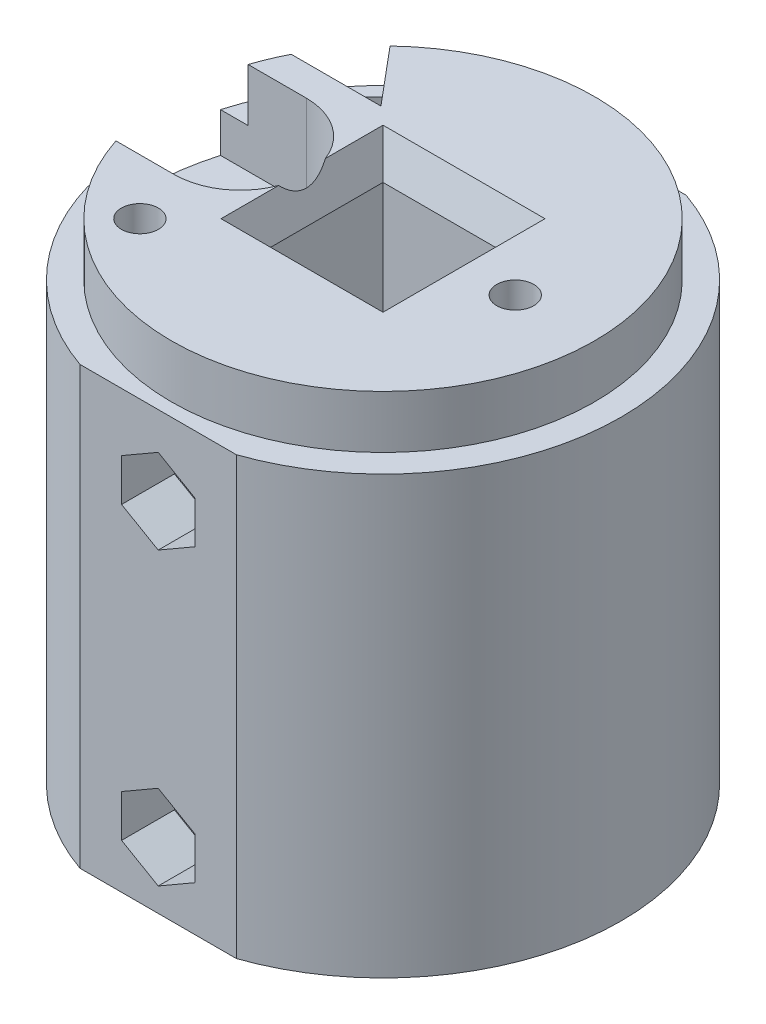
ISO-10303-21;
HEADER;
FILE_DESCRIPTION(('STEP AP214'),'2;1');
FILE_NAME('part.step','',(''),(''),'','','');
FILE_SCHEMA(('AUTOMOTIVE_DESIGN { 1 0 10303 214 1 1 1 1 }'));
ENDSEC;
DATA;
#1=APPLICATION_CONTEXT('core data for automotive mechanical design processes');
#2=APPLICATION_PROTOCOL_DEFINITION('international standard','automotive_design',2000,#1);
#3=PRODUCT_CONTEXT('',#1,'mechanical');
#4=PRODUCT('Part','Part','',(#3));
#5=PRODUCT_RELATED_PRODUCT_CATEGORY('part','',(#4));
#6=PRODUCT_DEFINITION_FORMATION('','',#4);
#7=PRODUCT_DEFINITION_CONTEXT('part definition',#1,'design');
#8=PRODUCT_DEFINITION('design','',#6,#7);
#9=PRODUCT_DEFINITION_SHAPE('','',#8);
#10=(LENGTH_UNIT() NAMED_UNIT(*) SI_UNIT(.MILLI.,.METRE.));
#11=(NAMED_UNIT(*) PLANE_ANGLE_UNIT() SI_UNIT($,.RADIAN.));
#12=(NAMED_UNIT(*) SI_UNIT($,.STERADIAN.) SOLID_ANGLE_UNIT());
#13=UNCERTAINTY_MEASURE_WITH_UNIT(LENGTH_MEASURE(1.E-05),#10,'distance_accuracy_value','');
#14=(GEOMETRIC_REPRESENTATION_CONTEXT(3) GLOBAL_UNCERTAINTY_ASSIGNED_CONTEXT((#13)) GLOBAL_UNIT_ASSIGNED_CONTEXT((#10,
#11,#12)) REPRESENTATION_CONTEXT('',''));
#15=CARTESIAN_POINT('',(0.,0.,0.));
#16=DIRECTION('',(0.,0.,1.));
#17=DIRECTION('',(1.,0.,0.));
#18=AXIS2_PLACEMENT_3D('',#15,#16,#17);
#19=CARTESIAN_POINT('',(0.,37.,0.));
#20=DIRECTION('',(0.,-1.,0.));
#21=DIRECTION('',(0.,0.,-1.));
#22=AXIS2_PLACEMENT_3D('',#19,#20,#21);
#23=CYLINDRICAL_SURFACE('',#22,18.);
#24=CARTESIAN_POINT('',(0.,33.,0.));
#25=DIRECTION('',(0.,1.,0.));
#26=DIRECTION('',(0.,0.,1.));
#27=AXIS2_PLACEMENT_3D('',#24,#25,#26);
#28=CIRCLE('',#27,18.);
#29=CARTESIAN_POINT('',(5.91607978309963,33.,17.));
#30=VERTEX_POINT('',#29);
#31=CARTESIAN_POINT('',(5.91607978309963,33.,-17.));
#32=VERTEX_POINT('',#31);
#33=EDGE_CURVE('E304',#30,#32,#28,.T.);
#34=ORIENTED_EDGE('',*,*,#33,.F.);
#35=DIRECTION('',(0.,-1.,0.));
#36=VECTOR('',#35,1.);
#37=CARTESIAN_POINT('',(5.91607978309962,37.,17.));
#38=LINE('',#37,#36);
#39=CARTESIAN_POINT('',(5.91607978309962,0.,17.));
#40=VERTEX_POINT('',#39);
#41=EDGE_CURVE('E583',#30,#40,#38,.T.);
#42=ORIENTED_EDGE('',*,*,#41,.T.);
#43=CARTESIAN_POINT('',(0.,0.,0.));
#44=DIRECTION('',(0.,1.,0.));
#45=DIRECTION('',(0.,0.,1.));
#46=AXIS2_PLACEMENT_3D('',#43,#44,#45);
#47=CIRCLE('',#46,18.);
#48=CARTESIAN_POINT('',(5.91607978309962,0.,-17.));
#49=VERTEX_POINT('',#48);
#50=EDGE_CURVE('E567',#40,#49,#47,.T.);
#51=ORIENTED_EDGE('',*,*,#50,.T.);
#52=DIRECTION('',(0.,-1.,0.));
#53=VECTOR('',#52,1.);
#54=CARTESIAN_POINT('',(5.91607978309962,37.,-17.));
#55=LINE('',#54,#53);
#56=EDGE_CURVE('E571',#49,#32,#55,.F.);
#57=ORIENTED_EDGE('',*,*,#56,.T.);
#58=EDGE_LOOP('',(#34,#42,#51,#57));
#59=FACE_BOUND('',#58,.T.);
#60=ADVANCED_FACE('F36',(#59),#23,.T.);
#61=CARTESIAN_POINT('',(0.,37.,0.));
#62=DIRECTION('',(0.,1.,0.));
#63=DIRECTION('',(0.,0.,1.));
#64=AXIS2_PLACEMENT_3D('',#61,#62,#63);
#65=PLANE('',#64);
#66=CARTESIAN_POINT('',(-9.19238815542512,37.,9.19238815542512));
#67=DIRECTION('',(0.,1.,0.));
#68=DIRECTION('',(0.,0.,1.));
#69=AXIS2_PLACEMENT_3D('',#66,#67,#68);
#70=CIRCLE('',#69,1.4);
#71=CARTESIAN_POINT('',(-9.19238815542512,37.,10.5923881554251));
#72=VERTEX_POINT('',#71);
#73=EDGE_CURVE('E321',#72,#72,#70,.T.);
#74=ORIENTED_EDGE('',*,*,#73,.F.);
#75=EDGE_LOOP('',(#74));
#76=FACE_BOUND('',#75,.T.);
#77=CARTESIAN_POINT('',(10.,37.,0.));
#78=DIRECTION('',(0.,1.,0.));
#79=DIRECTION('',(0.,0.,1.));
#80=AXIS2_PLACEMENT_3D('',#77,#78,#79);
#81=CIRCLE('',#80,1.4);
#82=CARTESIAN_POINT('',(10.,37.,1.4));
#83=VERTEX_POINT('',#82);
#84=EDGE_CURVE('E325',#83,#83,#81,.T.);
#85=ORIENTED_EDGE('',*,*,#84,.F.);
#86=EDGE_LOOP('',(#85));
#87=FACE_BOUND('',#86,.T.);
#88=DIRECTION('',(-1.,0.,0.));
#89=VECTOR('',#88,1.);
#90=CARTESIAN_POINT('',(-7.45420317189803,37.,-7.29788996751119));
#91=LINE('',#90,#89);
#92=CARTESIAN_POINT('',(-7.45420317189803,37.,-7.29788996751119));
#93=VERTEX_POINT('',#92);
#94=CARTESIAN_POINT('',(-14.2387078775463,37.,-7.2978899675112));
#95=VERTEX_POINT('',#94);
#96=EDGE_CURVE('E334',#93,#95,#91,.T.);
#97=ORIENTED_EDGE('',*,*,#96,.T.);
#98=CARTESIAN_POINT('',(0.,37.,0.));
#99=DIRECTION('',(0.,1.,0.));
#100=DIRECTION('',(0.,0.,1.));
#101=AXIS2_PLACEMENT_3D('',#98,#99,#100);
#102=CIRCLE('',#101,16.);
#103=CARTESIAN_POINT('',(-15.1986841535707,37.,-5.));
#104=VERTEX_POINT('',#103);
#105=EDGE_CURVE('E51',#95,#104,#102,.T.);
#106=ORIENTED_EDGE('',*,*,#105,.T.);
#107=DIRECTION('',(-1.,0.,0.));
#108=VECTOR('',#107,1.);
#109=CARTESIAN_POINT('',(-10.8,37.,-5.));
#110=LINE('',#109,#108);
#111=CARTESIAN_POINT('',(-10.8,37.,-5.));
#112=VERTEX_POINT('',#111);
#113=EDGE_CURVE('E530',#112,#104,#110,.T.);
#114=ORIENTED_EDGE('',*,*,#113,.F.);
#115=CARTESIAN_POINT('',(-10.8,37.,0.));
#116=DIRECTION('',(0.,1.,0.));
#117=DIRECTION('',(0.,0.,-1.));
#118=AXIS2_PLACEMENT_3D('',#115,#116,#117);
#119=CIRCLE('',#118,5.);
#120=CARTESIAN_POINT('',(-6.12500000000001,37.,-1.77323856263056));
#121=VERTEX_POINT('',#120);
#122=EDGE_CURVE('E531',#121,#112,#119,.T.);
#123=ORIENTED_EDGE('',*,*,#122,.F.);
#124=DIRECTION('',(0.,0.,-1.));
#125=VECTOR('',#124,1.);
#126=CARTESIAN_POINT('',(-6.12500000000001,37.,0.));
#127=LINE('',#126,#125);
#128=CARTESIAN_POINT('',(-6.12500000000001,37.,-6.125));
#129=VERTEX_POINT('',#128);
#130=EDGE_CURVE('E602',#121,#129,#127,.T.);
#131=ORIENTED_EDGE('',*,*,#130,.T.);
#132=DIRECTION('',(1.,0.,0.));
#133=VECTOR('',#132,1.);
#134=CARTESIAN_POINT('',(0.,37.,-6.125));
#135=LINE('',#134,#133);
#136=CARTESIAN_POINT('',(6.12499999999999,37.,-6.12500000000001));
#137=VERTEX_POINT('',#136);
#138=EDGE_CURVE('E600',#129,#137,#135,.T.);
#139=ORIENTED_EDGE('',*,*,#138,.T.);
#140=DIRECTION('',(0.,0.,1.));
#141=VECTOR('',#140,1.);
#142=CARTESIAN_POINT('',(6.12499999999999,37.,0.));
#143=LINE('',#142,#141);
#144=CARTESIAN_POINT('',(6.12499999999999,37.,6.125));
#145=VERTEX_POINT('',#144);
#146=EDGE_CURVE('E596',#137,#145,#143,.T.);
#147=ORIENTED_EDGE('',*,*,#146,.T.);
#148=DIRECTION('',(-1.,0.,0.));
#149=VECTOR('',#148,1.);
#150=CARTESIAN_POINT('',(0.,37.,6.125));
#151=LINE('',#150,#149);
#152=CARTESIAN_POINT('',(-6.12500000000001,37.,6.125));
#153=VERTEX_POINT('',#152);
#154=EDGE_CURVE('E598',#145,#153,#151,.T.);
#155=ORIENTED_EDGE('',*,*,#154,.T.);
#156=DIRECTION('',(0.,0.,-1.));
#157=VECTOR('',#156,1.);
#158=CARTESIAN_POINT('',(-6.12500000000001,37.,0.));
#159=LINE('',#158,#157);
#160=CARTESIAN_POINT('',(-6.12500000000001,37.,1.77323856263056));
#161=VERTEX_POINT('',#160);
#162=EDGE_CURVE('E604',#153,#161,#159,.T.);
#163=ORIENTED_EDGE('',*,*,#162,.T.);
#164=CARTESIAN_POINT('',(-10.8,37.,5.));
#165=VERTEX_POINT('',#164);
#166=EDGE_CURVE('E527',#165,#161,#119,.T.);
#167=ORIENTED_EDGE('',*,*,#166,.F.);
#168=DIRECTION('',(1.,0.,0.));
#169=VECTOR('',#168,1.);
#170=CARTESIAN_POINT('',(-10.8,37.,5.));
#171=LINE('',#170,#169);
#172=CARTESIAN_POINT('',(-15.1986841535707,37.,5.));
#173=VERTEX_POINT('',#172);
#174=EDGE_CURVE('E519',#173,#165,#171,.T.);
#175=ORIENTED_EDGE('',*,*,#174,.F.);
#176=CARTESIAN_POINT('',(-11.0445089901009,37.,-11.5766498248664));
#177=VERTEX_POINT('',#176);
#178=EDGE_CURVE('E698',#173,#177,#102,.T.);
#179=ORIENTED_EDGE('',*,*,#178,.T.);
#180=DIRECTION('',(0.642787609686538,0.,0.766044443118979));
#181=VECTOR('',#180,1.);
#182=CARTESIAN_POINT('',(-7.45420317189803,37.,-7.29788996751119));
#183=LINE('',#182,#181);
#184=EDGE_CURVE('E302',#177,#93,#183,.T.);
#185=ORIENTED_EDGE('',*,*,#184,.T.);
#186=EDGE_LOOP('',(#97,#106,#114,#123,#131,#139,#147,#155,#163,#167,#175,#179,#185));
#187=FACE_BOUND('',#186,.T.);
#188=ADVANCED_FACE('F686',(#76,#87,#187),#65,.T.);
#189=CARTESIAN_POINT('',(-5.91607978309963,33.,-17.));
#190=VERTEX_POINT('',#189);
#191=CARTESIAN_POINT('',(-17.2916164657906,33.,-5.));
#192=VERTEX_POINT('',#191);
#193=EDGE_CURVE('E307',#190,#192,#28,.T.);
#194=ORIENTED_EDGE('',*,*,#193,.F.);
#195=DIRECTION('',(0.,-1.,0.));
#196=VECTOR('',#195,1.);
#197=CARTESIAN_POINT('',(-5.91607978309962,37.,-17.));
#198=LINE('',#197,#196);
#199=CARTESIAN_POINT('',(-5.91607978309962,0.,-17.));
#200=VERTEX_POINT('',#199);
#201=EDGE_CURVE('E578',#190,#200,#198,.T.);
#202=ORIENTED_EDGE('',*,*,#201,.T.);
#203=CARTESIAN_POINT('',(-5.91607978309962,0.,17.));
#204=VERTEX_POINT('',#203);
#205=EDGE_CURVE('E568',#200,#204,#47,.T.);
#206=ORIENTED_EDGE('',*,*,#205,.T.);
#207=DIRECTION('',(0.,-1.,0.));
#208=VECTOR('',#207,1.);
#209=CARTESIAN_POINT('',(-5.91607978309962,37.,17.));
#210=LINE('',#209,#208);
#211=CARTESIAN_POINT('',(-5.91607978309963,33.,17.));
#212=VERTEX_POINT('',#211);
#213=EDGE_CURVE('E580',#204,#212,#210,.F.);
#214=ORIENTED_EDGE('',*,*,#213,.T.);
#215=CARTESIAN_POINT('',(-17.2916164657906,33.,5.));
#216=VERTEX_POINT('',#215);
#217=EDGE_CURVE('E309',#216,#212,#28,.T.);
#218=ORIENTED_EDGE('',*,*,#217,.F.);
#219=DIRECTION('',(0.,1.,0.));
#220=VECTOR('',#219,1.);
#221=CARTESIAN_POINT('',(-17.2916164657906,30.,4.99999999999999));
#222=LINE('',#221,#220);
#223=CARTESIAN_POINT('',(-17.2916164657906,30.,4.99999999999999));
#224=VERTEX_POINT('',#223);
#225=EDGE_CURVE('E539',#224,#216,#222,.T.);
#226=ORIENTED_EDGE('',*,*,#225,.F.);
#227=CARTESIAN_POINT('',(0.,30.,0.));
#228=DIRECTION('',(0.,1.,0.));
#229=DIRECTION('',(0.,0.,1.));
#230=AXIS2_PLACEMENT_3D('',#227,#228,#229);
#231=CIRCLE('',#230,18.);
#232=CARTESIAN_POINT('',(-17.2916164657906,30.,-5.));
#233=VERTEX_POINT('',#232);
#234=EDGE_CURVE('E521',#233,#224,#231,.T.);
#235=ORIENTED_EDGE('',*,*,#234,.F.);
#236=DIRECTION('',(0.,1.,0.));
#237=VECTOR('',#236,1.);
#238=CARTESIAN_POINT('',(-17.2916164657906,30.,-5.));
#239=LINE('',#238,#237);
#240=EDGE_CURVE('E542',#233,#192,#239,.T.);
#241=ORIENTED_EDGE('',*,*,#240,.T.);
#242=EDGE_LOOP('',(#194,#202,#206,#214,#218,#226,#235,#241));
#243=FACE_BOUND('',#242,.T.);
#244=ADVANCED_FACE('F708',(#243),#23,.T.);
#245=CARTESIAN_POINT('',(-10.8,30.,5.));
#246=DIRECTION('',(0.,0.,1.));
#247=DIRECTION('',(1.,0.,0.));
#248=AXIS2_PLACEMENT_3D('',#245,#246,#247);
#249=PLANE('',#248);
#250=DIRECTION('',(-1.,0.,0.));
#251=VECTOR('',#250,1.);
#252=CARTESIAN_POINT('',(-10.8,33.,5.));
#253=LINE('',#252,#251);
#254=CARTESIAN_POINT('',(-15.1986841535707,33.,5.));
#255=VERTEX_POINT('',#254);
#256=EDGE_CURVE('E319',#255,#216,#253,.T.);
#257=ORIENTED_EDGE('',*,*,#256,.F.);
#258=DIRECTION('',(0.,1.,0.));
#259=VECTOR('',#258,1.);
#260=CARTESIAN_POINT('',(-15.1986841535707,33.,5.));
#261=LINE('',#260,#259);
#262=EDGE_CURVE('E297',#173,#255,#261,.F.);
#263=ORIENTED_EDGE('',*,*,#262,.F.);
#264=ORIENTED_EDGE('',*,*,#174,.T.);
#265=DIRECTION('',(0.,1.,0.));
#266=VECTOR('',#265,1.);
#267=CARTESIAN_POINT('',(-10.8,30.,5.));
#268=LINE('',#267,#266);
#269=CARTESIAN_POINT('',(-10.8,30.,5.));
#270=VERTEX_POINT('',#269);
#271=EDGE_CURVE('E535',#270,#165,#268,.T.);
#272=ORIENTED_EDGE('',*,*,#271,.F.);
#273=DIRECTION('',(1.,0.,0.));
#274=VECTOR('',#273,1.);
#275=CARTESIAN_POINT('',(-10.8,30.,5.));
#276=LINE('',#275,#274);
#277=EDGE_CURVE('E523',#224,#270,#276,.T.);
#278=ORIENTED_EDGE('',*,*,#277,.F.);
#279=ORIENTED_EDGE('',*,*,#225,.T.);
#280=EDGE_LOOP('',(#257,#263,#264,#272,#278,#279));
#281=FACE_BOUND('',#280,.T.);
#282=ADVANCED_FACE('F696',(#281),#249,.F.);
#283=CARTESIAN_POINT('',(-10.8,30.,-5.));
#284=DIRECTION('',(0.,0.,-1.));
#285=DIRECTION('',(-1.,0.,0.));
#286=AXIS2_PLACEMENT_3D('',#283,#284,#285);
#287=PLANE('',#286);
#288=DIRECTION('',(1.,0.,0.));
#289=VECTOR('',#288,1.);
#290=CARTESIAN_POINT('',(-10.8,33.,-5.));
#291=LINE('',#290,#289);
#292=CARTESIAN_POINT('',(-15.1986841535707,33.,-5.));
#293=VERTEX_POINT('',#292);
#294=EDGE_CURVE('E317',#192,#293,#291,.T.);
#295=ORIENTED_EDGE('',*,*,#294,.F.);
#296=ORIENTED_EDGE('',*,*,#240,.F.);
#297=DIRECTION('',(-1.,0.,0.));
#298=VECTOR('',#297,1.);
#299=CARTESIAN_POINT('',(-10.8,30.,-5.));
#300=LINE('',#299,#298);
#301=CARTESIAN_POINT('',(-10.8,30.,-5.));
#302=VERTEX_POINT('',#301);
#303=EDGE_CURVE('E518',#302,#233,#300,.T.);
#304=ORIENTED_EDGE('',*,*,#303,.F.);
#305=DIRECTION('',(0.,1.,0.));
#306=VECTOR('',#305,1.);
#307=CARTESIAN_POINT('',(-10.8,30.,-5.));
#308=LINE('',#307,#306);
#309=EDGE_CURVE('E526',#302,#112,#308,.T.);
#310=ORIENTED_EDGE('',*,*,#309,.T.);
#311=ORIENTED_EDGE('',*,*,#113,.T.);
#312=DIRECTION('',(0.,1.,0.));
#313=VECTOR('',#312,1.);
#314=CARTESIAN_POINT('',(-15.1986841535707,33.,-5.));
#315=LINE('',#314,#313);
#316=EDGE_CURVE('E303',#293,#104,#315,.T.);
#317=ORIENTED_EDGE('',*,*,#316,.F.);
#318=EDGE_LOOP('',(#295,#296,#304,#310,#311,#317));
#319=FACE_BOUND('',#318,.T.);
#320=ADVANCED_FACE('F700',(#319),#287,.F.);
#321=CARTESIAN_POINT('',(5.91607978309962,-3.,-17.));
#322=DIRECTION('',(0.,0.,1.));
#323=DIRECTION('',(1.,0.,0.));
#324=AXIS2_PLACEMENT_3D('',#321,#322,#323);
#325=PLANE('',#324);
#326=CARTESIAN_POINT('',(0.,27.,-17.));
#327=DIRECTION('',(0.,0.,-1.));
#328=DIRECTION('',(-1.,0.,0.));
#329=AXIS2_PLACEMENT_3D('',#326,#327,#328);
#330=CIRCLE('',#329,3.);
#331=CARTESIAN_POINT('',(-3.,27.,-17.));
#332=VERTEX_POINT('',#331);
#333=EDGE_CURVE('E461',#332,#332,#330,.T.);
#334=ORIENTED_EDGE('',*,*,#333,.F.);
#335=EDGE_LOOP('',(#334));
#336=FACE_BOUND('',#335,.T.);
#337=CARTESIAN_POINT('',(0.,5.,-17.));
#338=DIRECTION('',(0.,0.,-1.));
#339=DIRECTION('',(-1.,0.,0.));
#340=AXIS2_PLACEMENT_3D('',#337,#338,#339);
#341=CIRCLE('',#340,3.);
#342=CARTESIAN_POINT('',(-3.00000000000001,5.,-17.));
#343=VERTEX_POINT('',#342);
#344=EDGE_CURVE('E454',#343,#343,#341,.T.);
#345=ORIENTED_EDGE('',*,*,#344,.F.);
#346=EDGE_LOOP('',(#345));
#347=FACE_BOUND('',#346,.T.);
#348=DIRECTION('',(-1.,0.,0.));
#349=VECTOR('',#348,1.);
#350=CARTESIAN_POINT('',(5.91607978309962,33.,-17.));
#351=LINE('',#350,#349);
#352=EDGE_CURVE('E315',#32,#190,#351,.T.);
#353=ORIENTED_EDGE('',*,*,#352,.F.);
#354=ORIENTED_EDGE('',*,*,#56,.F.);
#355=DIRECTION('',(1.,0.,0.));
#356=VECTOR('',#355,1.);
#357=CARTESIAN_POINT('',(0.,0.,-17.));
#358=LINE('',#357,#356);
#359=EDGE_CURVE('E479',#200,#49,#358,.T.);
#360=ORIENTED_EDGE('',*,*,#359,.F.);
#361=ORIENTED_EDGE('',*,*,#201,.F.);
#362=EDGE_LOOP('',(#353,#354,#360,#361));
#363=FACE_BOUND('',#362,.T.);
#364=ADVANCED_FACE('F722',(#336,#347,#363),#325,.F.);
#365=CARTESIAN_POINT('',(5.91607978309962,-3.,17.));
#366=DIRECTION('',(0.,0.,-1.));
#367=DIRECTION('',(-1.,0.,0.));
#368=AXIS2_PLACEMENT_3D('',#365,#366,#367);
#369=PLANE('',#368);
#370=DIRECTION('',(0.866025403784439,0.499999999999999,0.));
#371=VECTOR('',#370,1.);
#372=CARTESIAN_POINT('',(0.,23.8,17.));
#373=LINE('',#372,#371);
#374=CARTESIAN_POINT('',(0.,23.8,17.));
#375=VERTEX_POINT('',#374);
#376=CARTESIAN_POINT('',(2.7712812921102,25.4,17.));
#377=VERTEX_POINT('',#376);
#378=EDGE_CURVE('E423',#375,#377,#373,.T.);
#379=ORIENTED_EDGE('',*,*,#378,.F.);
#380=DIRECTION('',(0.866025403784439,-0.499999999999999,0.));
#381=VECTOR('',#380,1.);
#382=CARTESIAN_POINT('',(-2.7712812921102,25.4,17.));
#383=LINE('',#382,#381);
#384=CARTESIAN_POINT('',(-2.7712812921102,25.4,17.));
#385=VERTEX_POINT('',#384);
#386=EDGE_CURVE('E421',#385,#375,#383,.T.);
#387=ORIENTED_EDGE('',*,*,#386,.F.);
#388=DIRECTION('',(0.,-1.,0.));
#389=VECTOR('',#388,1.);
#390=CARTESIAN_POINT('',(-2.7712812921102,28.6,17.));
#391=LINE('',#390,#389);
#392=CARTESIAN_POINT('',(-2.7712812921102,28.6,17.));
#393=VERTEX_POINT('',#392);
#394=EDGE_CURVE('E405',#393,#385,#391,.T.);
#395=ORIENTED_EDGE('',*,*,#394,.F.);
#396=DIRECTION('',(-0.866025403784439,-0.5,0.));
#397=VECTOR('',#396,1.);
#398=CARTESIAN_POINT('',(0.,30.2,17.));
#399=LINE('',#398,#397);
#400=CARTESIAN_POINT('',(0.,30.2,17.));
#401=VERTEX_POINT('',#400);
#402=EDGE_CURVE('E432',#401,#393,#399,.T.);
#403=ORIENTED_EDGE('',*,*,#402,.F.);
#404=DIRECTION('',(-0.866025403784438,0.5,0.));
#405=VECTOR('',#404,1.);
#406=CARTESIAN_POINT('',(2.7712812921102,28.6,17.));
#407=LINE('',#406,#405);
#408=CARTESIAN_POINT('',(2.7712812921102,28.6,17.));
#409=VERTEX_POINT('',#408);
#410=EDGE_CURVE('E429',#409,#401,#407,.T.);
#411=ORIENTED_EDGE('',*,*,#410,.F.);
#412=DIRECTION('',(0.,1.,0.));
#413=VECTOR('',#412,1.);
#414=CARTESIAN_POINT('',(2.7712812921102,25.4,17.));
#415=LINE('',#414,#413);
#416=EDGE_CURVE('E426',#377,#409,#415,.T.);
#417=ORIENTED_EDGE('',*,*,#416,.F.);
#418=EDGE_LOOP('',(#379,#387,#395,#403,#411,#417));
#419=FACE_BOUND('',#418,.T.);
#420=DIRECTION('',(0.866025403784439,0.5,0.));
#421=VECTOR('',#420,1.);
#422=CARTESIAN_POINT('',(0.,1.8,17.));
#423=LINE('',#422,#421);
#424=CARTESIAN_POINT('',(0.,1.8,17.));
#425=VERTEX_POINT('',#424);
#426=CARTESIAN_POINT('',(2.7712812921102,3.4,17.));
#427=VERTEX_POINT('',#426);
#428=EDGE_CURVE('E373',#425,#427,#423,.T.);
#429=ORIENTED_EDGE('',*,*,#428,.F.);
#430=DIRECTION('',(0.866025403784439,-0.499999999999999,0.));
#431=VECTOR('',#430,1.);
#432=CARTESIAN_POINT('',(-2.7712812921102,3.4,17.));
#433=LINE('',#432,#431);
#434=CARTESIAN_POINT('',(-2.7712812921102,3.4,17.));
#435=VERTEX_POINT('',#434);
#436=EDGE_CURVE('E371',#435,#425,#433,.T.);
#437=ORIENTED_EDGE('',*,*,#436,.F.);
#438=DIRECTION('',(0.,-1.,0.));
#439=VECTOR('',#438,1.);
#440=CARTESIAN_POINT('',(-2.77128129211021,6.6,17.));
#441=LINE('',#440,#439);
#442=CARTESIAN_POINT('',(-2.77128129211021,6.6,17.));
#443=VERTEX_POINT('',#442);
#444=EDGE_CURVE('E355',#443,#435,#441,.T.);
#445=ORIENTED_EDGE('',*,*,#444,.F.);
#446=DIRECTION('',(-0.866025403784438,-0.500000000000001,0.));
#447=VECTOR('',#446,1.);
#448=CARTESIAN_POINT('',(0.,8.2,17.));
#449=LINE('',#448,#447);
#450=CARTESIAN_POINT('',(0.,8.2,17.));
#451=VERTEX_POINT('',#450);
#452=EDGE_CURVE('E383',#451,#443,#449,.T.);
#453=ORIENTED_EDGE('',*,*,#452,.F.);
#454=DIRECTION('',(-0.866025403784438,0.5,0.));
#455=VECTOR('',#454,1.);
#456=CARTESIAN_POINT('',(2.7712812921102,6.6,17.));
#457=LINE('',#456,#455);
#458=CARTESIAN_POINT('',(2.7712812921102,6.6,17.));
#459=VERTEX_POINT('',#458);
#460=EDGE_CURVE('E380',#459,#451,#457,.T.);
#461=ORIENTED_EDGE('',*,*,#460,.F.);
#462=DIRECTION('',(0.,1.,0.));
#463=VECTOR('',#462,1.);
#464=CARTESIAN_POINT('',(2.7712812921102,3.4,17.));
#465=LINE('',#464,#463);
#466=EDGE_CURVE('E377',#427,#459,#465,.T.);
#467=ORIENTED_EDGE('',*,*,#466,.F.);
#468=EDGE_LOOP('',(#429,#437,#445,#453,#461,#467));
#469=FACE_BOUND('',#468,.T.);
#470=DIRECTION('',(1.,0.,0.));
#471=VECTOR('',#470,1.);
#472=CARTESIAN_POINT('',(5.91607978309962,33.,17.));
#473=LINE('',#472,#471);
#474=EDGE_CURVE('E290',#212,#30,#473,.T.);
#475=ORIENTED_EDGE('',*,*,#474,.F.);
#476=ORIENTED_EDGE('',*,*,#213,.F.);
#477=DIRECTION('',(-1.,0.,0.));
#478=VECTOR('',#477,1.);
#479=CARTESIAN_POINT('',(0.,0.,17.));
#480=LINE('',#479,#478);
#481=EDGE_CURVE('E476',#40,#204,#480,.T.);
#482=ORIENTED_EDGE('',*,*,#481,.F.);
#483=ORIENTED_EDGE('',*,*,#41,.F.);
#484=EDGE_LOOP('',(#475,#476,#482,#483));
#485=FACE_BOUND('',#484,.T.);
#486=ADVANCED_FACE('F714',(#419,#469,#485),#369,.F.);
#487=CARTESIAN_POINT('',(-7.45420317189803,37.,-7.29788996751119));
#488=DIRECTION('',(0.766044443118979,0.,-0.642787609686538));
#489=DIRECTION('',(-0.642787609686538,0.,-0.76604444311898));
#490=AXIS2_PLACEMENT_3D('',#487,#488,#489);
#491=PLANE('',#490);
#492=DIRECTION('',(0.642787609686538,0.,0.76604444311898));
#493=VECTOR('',#492,1.);
#494=CARTESIAN_POINT('',(-7.45420317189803,33.,-7.29788996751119));
#495=LINE('',#494,#493);
#496=CARTESIAN_POINT('',(-11.6323226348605,33.,-12.2771788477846));
#497=VERTEX_POINT('',#496);
#498=CARTESIAN_POINT('',(-11.0445089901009,33.,-11.5766498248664));
#499=VERTEX_POINT('',#498);
#500=EDGE_CURVE('E281',#497,#499,#495,.T.);
#501=ORIENTED_EDGE('',*,*,#500,.F.);
#502=DIRECTION('',(0.,-1.,0.));
#503=VECTOR('',#502,1.);
#504=CARTESIAN_POINT('',(-11.6323226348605,37.,-12.2771788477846));
#505=LINE('',#504,#503);
#506=CARTESIAN_POINT('',(-11.6323226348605,0.,-12.2771788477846));
#507=VERTEX_POINT('',#506);
#508=EDGE_CURVE('E345',#497,#507,#505,.T.);
#509=ORIENTED_EDGE('',*,*,#508,.T.);
#510=DIRECTION('',(0.642787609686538,0.,0.766044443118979));
#511=VECTOR('',#510,1.);
#512=CARTESIAN_POINT('',(-7.45420317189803,0.,-7.29788996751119));
#513=LINE('',#512,#511);
#514=CARTESIAN_POINT('',(-7.45420317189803,0.,-7.29788996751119));
#515=VERTEX_POINT('',#514);
#516=EDGE_CURVE('E59',#507,#515,#513,.T.);
#517=ORIENTED_EDGE('',*,*,#516,.T.);
#518=DIRECTION('',(0.,-1.,0.));
#519=VECTOR('',#518,1.);
#520=CARTESIAN_POINT('',(-7.45420317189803,37.,-7.29788996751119));
#521=LINE('',#520,#519);
#522=EDGE_CURVE('E338',#93,#515,#521,.T.);
#523=ORIENTED_EDGE('',*,*,#522,.F.);
#524=ORIENTED_EDGE('',*,*,#184,.F.);
#525=DIRECTION('',(0.,1.,0.));
#526=VECTOR('',#525,1.);
#527=CARTESIAN_POINT('',(-11.0445089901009,33.,-11.5766498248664));
#528=LINE('',#527,#526);
#529=EDGE_CURVE('E294',#499,#177,#528,.T.);
#530=ORIENTED_EDGE('',*,*,#529,.F.);
#531=EDGE_LOOP('',(#501,#509,#517,#523,#524,#530));
#532=FACE_BOUND('',#531,.T.);
#533=ADVANCED_FACE('F301',(#532),#491,.F.);
#534=CARTESIAN_POINT('',(0.516799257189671,37.,1.00434355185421));
#535=DIRECTION('',(0.,-1.,0.));
#536=DIRECTION('',(0.,0.,-1.));
#537=AXIS2_PLACEMENT_3D('',#534,#535,#536);
#538=CYLINDRICAL_SURFACE('',#537,18.);
#539=CARTESIAN_POINT('',(0.516799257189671,33.,1.00434355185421));
#540=DIRECTION('',(0.,1.,0.));
#541=DIRECTION('',(0.,0.,1.));
#542=AXIS2_PLACEMENT_3D('',#539,#540,#541);
#543=CIRCLE('',#542,18.);
#544=CARTESIAN_POINT('',(-15.454203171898,33.,-7.2978899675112));
#545=VERTEX_POINT('',#544);
#546=EDGE_CURVE('E287',#545,#497,#543,.F.);
#547=ORIENTED_EDGE('',*,*,#546,.F.);
#548=DIRECTION('',(0.,-1.,0.));
#549=VECTOR('',#548,1.);
#550=CARTESIAN_POINT('',(-15.454203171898,37.,-7.2978899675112));
#551=LINE('',#550,#549);
#552=CARTESIAN_POINT('',(-15.454203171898,0.,-7.2978899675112));
#553=VERTEX_POINT('',#552);
#554=EDGE_CURVE('E348',#545,#553,#551,.T.);
#555=ORIENTED_EDGE('',*,*,#554,.T.);
#556=CARTESIAN_POINT('',(0.516799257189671,0.,1.00434355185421));
#557=DIRECTION('',(0.,-1.,0.));
#558=DIRECTION('',(0.,0.,-1.));
#559=AXIS2_PLACEMENT_3D('',#556,#557,#558);
#560=CIRCLE('',#559,18.);
#561=EDGE_CURVE('E335',#553,#507,#560,.T.);
#562=ORIENTED_EDGE('',*,*,#561,.T.);
#563=ORIENTED_EDGE('',*,*,#508,.F.);
#564=EDGE_LOOP('',(#547,#555,#562,#563));
#565=FACE_BOUND('',#564,.T.);
#566=ADVANCED_FACE('F636',(#565),#538,.F.);
#567=CARTESIAN_POINT('',(-7.45420317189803,37.,-7.29788996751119));
#568=DIRECTION('',(0.,0.,1.));
#569=DIRECTION('',(1.,0.,0.));
#570=AXIS2_PLACEMENT_3D('',#567,#568,#569);
#571=PLANE('',#570);
#572=DIRECTION('',(-1.,0.,0.));
#573=VECTOR('',#572,1.);
#574=CARTESIAN_POINT('',(-7.45420317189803,33.,-7.29788996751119));
#575=LINE('',#574,#573);
#576=CARTESIAN_POINT('',(-14.2387078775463,33.,-7.2978899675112));
#577=VERTEX_POINT('',#576);
#578=EDGE_CURVE('E12',#577,#545,#575,.T.);
#579=ORIENTED_EDGE('',*,*,#578,.F.);
#580=DIRECTION('',(0.,1.,0.));
#581=VECTOR('',#580,1.);
#582=CARTESIAN_POINT('',(-14.2387078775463,33.,-7.2978899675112));
#583=LINE('',#582,#581);
#584=EDGE_CURVE('E44',#95,#577,#583,.F.);
#585=ORIENTED_EDGE('',*,*,#584,.F.);
#586=ORIENTED_EDGE('',*,*,#96,.F.);
#587=ORIENTED_EDGE('',*,*,#522,.T.);
#588=DIRECTION('',(-1.,0.,0.));
#589=VECTOR('',#588,1.);
#590=CARTESIAN_POINT('',(-7.45420317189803,0.,-7.29788996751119));
#591=LINE('',#590,#589);
#592=EDGE_CURVE('E340',#515,#553,#591,.T.);
#593=ORIENTED_EDGE('',*,*,#592,.T.);
#594=ORIENTED_EDGE('',*,*,#554,.F.);
#595=EDGE_LOOP('',(#579,#585,#586,#587,#593,#594));
#596=FACE_BOUND('',#595,.T.);
#597=ADVANCED_FACE('F632',(#596),#571,.F.);
#598=CARTESIAN_POINT('',(0.,5.,17.));
#599=DIRECTION('',(0.,0.,-1.));
#600=DIRECTION('',(-1.,0.,0.));
#601=AXIS2_PLACEMENT_3D('',#598,#599,#600);
#602=CYLINDRICAL_SURFACE('',#601,1.5);
#603=CARTESIAN_POINT('',(0.,5.,5.125));
#604=DIRECTION('',(0.,0.,-1.));
#605=DIRECTION('',(-1.,0.,0.));
#606=AXIS2_PLACEMENT_3D('',#603,#604,#605);
#607=CIRCLE('',#606,1.5);
#608=CARTESIAN_POINT('',(-1.50000000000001,5.,5.125));
#609=VERTEX_POINT('',#608);
#610=EDGE_CURVE('E467',#609,#609,#607,.T.);
#611=ORIENTED_EDGE('',*,*,#610,.T.);
#612=EDGE_LOOP('',(#611));
#613=FACE_BOUND('',#612,.T.);
#614=CARTESIAN_POINT('',(0.,5.,13.));
#615=DIRECTION('',(0.,0.,1.));
#616=DIRECTION('',(1.,0.,0.));
#617=AXIS2_PLACEMENT_3D('',#614,#615,#616);
#618=CIRCLE('',#617,1.5);
#619=CARTESIAN_POINT('',(1.5,5.,13.));
#620=VERTEX_POINT('',#619);
#621=EDGE_CURVE('E390',#620,#620,#618,.F.);
#622=ORIENTED_EDGE('',*,*,#621,.F.);
#623=EDGE_LOOP('',(#622));
#624=FACE_BOUND('',#623,.T.);
#625=ADVANCED_FACE('F1112',(#613,#624),#602,.F.);
#626=CARTESIAN_POINT('',(0.,27.,17.));
#627=DIRECTION('',(0.,0.,-1.));
#628=DIRECTION('',(-1.,0.,0.));
#629=AXIS2_PLACEMENT_3D('',#626,#627,#628);
#630=CYLINDRICAL_SURFACE('',#629,1.5);
#631=CARTESIAN_POINT('',(0.,27.,5.125));
#632=DIRECTION('',(0.,0.,-1.));
#633=DIRECTION('',(-1.,0.,0.));
#634=AXIS2_PLACEMENT_3D('',#631,#632,#633);
#635=CIRCLE('',#634,1.5);
#636=CARTESIAN_POINT('',(-1.5,27.,5.125));
#637=VERTEX_POINT('',#636);
#638=EDGE_CURVE('E473',#637,#637,#635,.T.);
#639=ORIENTED_EDGE('',*,*,#638,.T.);
#640=EDGE_LOOP('',(#639));
#641=FACE_BOUND('',#640,.T.);
#642=CARTESIAN_POINT('',(0.,27.,13.));
#643=DIRECTION('',(0.,0.,1.));
#644=DIRECTION('',(1.,0.,0.));
#645=AXIS2_PLACEMENT_3D('',#642,#643,#644);
#646=CIRCLE('',#645,1.5);
#647=CARTESIAN_POINT('',(1.5,27.,13.));
#648=VERTEX_POINT('',#647);
#649=EDGE_CURVE('E439',#648,#648,#646,.F.);
#650=ORIENTED_EDGE('',*,*,#649,.F.);
#651=EDGE_LOOP('',(#650));
#652=FACE_BOUND('',#651,.T.);
#653=ADVANCED_FACE('F1164',(#641,#652),#630,.F.);
#654=CARTESIAN_POINT('',(0.,5.,-5.125));
#655=DIRECTION('',(0.,0.,1.));
#656=DIRECTION('',(1.,0.,0.));
#657=AXIS2_PLACEMENT_3D('',#654,#655,#656);
#658=CIRCLE('',#657,1.5);
#659=CARTESIAN_POINT('',(1.5,5.,-5.125));
#660=VERTEX_POINT('',#659);
#661=EDGE_CURVE('E464',#660,#660,#658,.T.);
#662=ORIENTED_EDGE('',*,*,#661,.T.);
#663=EDGE_LOOP('',(#662));
#664=FACE_BOUND('',#663,.T.);
#665=CARTESIAN_POINT('',(0.,5.,-14.));
#666=DIRECTION('',(0.,0.,-1.));
#667=DIRECTION('',(-1.,0.,0.));
#668=AXIS2_PLACEMENT_3D('',#665,#666,#667);
#669=CIRCLE('',#668,1.5);
#670=CARTESIAN_POINT('',(-1.50000000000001,5.,-14.));
#671=VERTEX_POINT('',#670);
#672=EDGE_CURVE('E453',#671,#671,#669,.F.);
#673=ORIENTED_EDGE('',*,*,#672,.F.);
#674=EDGE_LOOP('',(#673));
#675=FACE_BOUND('',#674,.T.);
#676=ADVANCED_FACE('F1167',(#664,#675),#602,.F.);
#677=CARTESIAN_POINT('',(0.,27.,-5.125));
#678=DIRECTION('',(0.,0.,1.));
#679=DIRECTION('',(1.,0.,0.));
#680=AXIS2_PLACEMENT_3D('',#677,#678,#679);
#681=CIRCLE('',#680,1.5);
#682=CARTESIAN_POINT('',(1.5,27.,-5.125));
#683=VERTEX_POINT('',#682);
#684=EDGE_CURVE('E470',#683,#683,#681,.T.);
#685=ORIENTED_EDGE('',*,*,#684,.T.);
#686=EDGE_LOOP('',(#685));
#687=FACE_BOUND('',#686,.T.);
#688=CARTESIAN_POINT('',(0.,27.,-14.));
#689=DIRECTION('',(0.,0.,-1.));
#690=DIRECTION('',(-1.,0.,0.));
#691=AXIS2_PLACEMENT_3D('',#688,#689,#690);
#692=CIRCLE('',#691,1.5);
#693=CARTESIAN_POINT('',(-1.5,27.,-14.));
#694=VERTEX_POINT('',#693);
#695=EDGE_CURVE('E460',#694,#694,#692,.F.);
#696=ORIENTED_EDGE('',*,*,#695,.F.);
#697=EDGE_LOOP('',(#696));
#698=FACE_BOUND('',#697,.T.);
#699=ADVANCED_FACE('F642',(#687,#698),#630,.F.);
#700=CARTESIAN_POINT('',(0.,0.,0.));
#701=DIRECTION('',(0.,1.,0.));
#702=DIRECTION('',(0.,0.,1.));
#703=AXIS2_PLACEMENT_3D('',#700,#701,#702);
#704=PLANE('',#703);
#705=ORIENTED_EDGE('',*,*,#592,.F.);
#706=ORIENTED_EDGE('',*,*,#516,.F.);
#707=ORIENTED_EDGE('',*,*,#561,.F.);
#708=EDGE_LOOP('',(#705,#706,#707));
#709=FACE_BOUND('',#708,.T.);
#710=DIRECTION('',(-1.,0.,0.));
#711=VECTOR('',#710,1.);
#712=CARTESIAN_POINT('',(-15.8103935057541,0.,3.80211003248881));
#713=LINE('',#712,#711);
#714=CARTESIAN_POINT('',(-6.46039350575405,0.,3.80211003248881));
#715=VERTEX_POINT('',#714);
#716=CARTESIAN_POINT('',(-15.8103935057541,0.,3.80211003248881));
#717=VERTEX_POINT('',#716);
#718=EDGE_CURVE('E498',#715,#717,#713,.T.);
#719=ORIENTED_EDGE('',*,*,#718,.F.);
#720=DIRECTION('',(0.,0.,1.));
#721=VECTOR('',#720,1.);
#722=CARTESIAN_POINT('',(-6.46039350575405,0.,-5.54788996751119));
#723=LINE('',#722,#721);
#724=CARTESIAN_POINT('',(-6.46039350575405,0.,-5.54788996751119));
#725=VERTEX_POINT('',#724);
#726=EDGE_CURVE('E482',#725,#715,#723,.T.);
#727=ORIENTED_EDGE('',*,*,#726,.F.);
#728=DIRECTION('',(1.,0.,0.));
#729=VECTOR('',#728,1.);
#730=CARTESIAN_POINT('',(-15.8103935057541,0.,-5.54788996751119));
#731=LINE('',#730,#729);
#732=CARTESIAN_POINT('',(-15.8103935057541,0.,-5.54788996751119));
#733=VERTEX_POINT('',#732);
#734=EDGE_CURVE('E487',#733,#725,#731,.T.);
#735=ORIENTED_EDGE('',*,*,#734,.F.);
#736=DIRECTION('',(0.,0.,-1.));
#737=VECTOR('',#736,1.);
#738=CARTESIAN_POINT('',(-15.8103935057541,0.,-5.54788996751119));
#739=LINE('',#738,#737);
#740=EDGE_CURVE('E501',#717,#733,#739,.T.);
#741=ORIENTED_EDGE('',*,*,#740,.F.);
#742=EDGE_LOOP('',(#719,#727,#735,#741));
#743=FACE_BOUND('',#742,.T.);
#744=ORIENTED_EDGE('',*,*,#50,.F.);
#745=ORIENTED_EDGE('',*,*,#481,.T.);
#746=ORIENTED_EDGE('',*,*,#205,.F.);
#747=ORIENTED_EDGE('',*,*,#359,.T.);
#748=EDGE_LOOP('',(#744,#745,#746,#747));
#749=FACE_BOUND('',#748,.T.);
#750=DIRECTION('',(0.,0.,1.));
#751=VECTOR('',#750,1.);
#752=CARTESIAN_POINT('',(-5.125,0.,5.125));
#753=LINE('',#752,#751);
#754=CARTESIAN_POINT('',(-5.12500000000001,0.,-5.125));
#755=VERTEX_POINT('',#754);
#756=CARTESIAN_POINT('',(-5.125,0.,5.125));
#757=VERTEX_POINT('',#756);
#758=EDGE_CURVE('E547',#755,#757,#753,.T.);
#759=ORIENTED_EDGE('',*,*,#758,.T.);
#760=DIRECTION('',(1.,0.,0.));
#761=VECTOR('',#760,1.);
#762=CARTESIAN_POINT('',(5.12499999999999,0.,5.125));
#763=LINE('',#762,#761);
#764=CARTESIAN_POINT('',(5.12499999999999,0.,5.125));
#765=VERTEX_POINT('',#764);
#766=EDGE_CURVE('E550',#757,#765,#763,.T.);
#767=ORIENTED_EDGE('',*,*,#766,.T.);
#768=DIRECTION('',(0.,0.,-1.));
#769=VECTOR('',#768,1.);
#770=CARTESIAN_POINT('',(5.12499999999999,0.,5.125));
#771=LINE('',#770,#769);
#772=CARTESIAN_POINT('',(5.12499999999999,0.,-5.12500000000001));
#773=VERTEX_POINT('',#772);
#774=EDGE_CURVE('E553',#765,#773,#771,.T.);
#775=ORIENTED_EDGE('',*,*,#774,.T.);
#776=DIRECTION('',(-1.,0.,0.));
#777=VECTOR('',#776,1.);
#778=CARTESIAN_POINT('',(5.12499999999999,0.,-5.12500000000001));
#779=LINE('',#778,#777);
#780=EDGE_CURVE('E556',#773,#755,#779,.T.);
#781=ORIENTED_EDGE('',*,*,#780,.T.);
#782=EDGE_LOOP('',(#759,#767,#775,#781));
#783=FACE_BOUND('',#782,.T.);
#784=ADVANCED_FACE('F638',(#709,#743,#749,#783),#704,.F.);
#785=CARTESIAN_POINT('',(-5.125,37.,5.125));
#786=DIRECTION('',(1.,0.,0.));
#787=DIRECTION('',(0.,0.,-1.));
#788=AXIS2_PLACEMENT_3D('',#785,#786,#787);
#789=PLANE('',#788);
#790=DIRECTION('',(0.,-1.,0.));
#791=VECTOR('',#790,1.);
#792=CARTESIAN_POINT('',(-5.12500000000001,37.,-5.125));
#793=LINE('',#792,#791);
#794=CARTESIAN_POINT('',(-5.12500000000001,34.2525225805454,-5.125));
#795=VERTEX_POINT('',#794);
#796=EDGE_CURVE('E559',#795,#755,#793,.T.);
#797=ORIENTED_EDGE('',*,*,#796,.F.);
#798=DIRECTION('',(0.,0.,1.));
#799=VECTOR('',#798,1.);
#800=CARTESIAN_POINT('',(-5.125,34.2525225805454,5.125));
#801=LINE('',#800,#799);
#802=CARTESIAN_POINT('',(-5.125,34.2525225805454,5.125));
#803=VERTEX_POINT('',#802);
#804=EDGE_CURVE('E585',#795,#803,#801,.T.);
#805=ORIENTED_EDGE('',*,*,#804,.T.);
#806=DIRECTION('',(0.,-1.,0.));
#807=VECTOR('',#806,1.);
#808=CARTESIAN_POINT('',(-5.125,37.,5.125));
#809=LINE('',#808,#807);
#810=EDGE_CURVE('E565',#803,#757,#809,.T.);
#811=ORIENTED_EDGE('',*,*,#810,.T.);
#812=ORIENTED_EDGE('',*,*,#758,.F.);
#813=EDGE_LOOP('',(#797,#805,#811,#812));
#814=FACE_BOUND('',#813,.T.);
#815=ADVANCED_FACE('F641',(#814),#789,.T.);
#816=CARTESIAN_POINT('',(5.12499999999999,37.,5.125));
#817=DIRECTION('',(0.,0.,-1.));
#818=DIRECTION('',(-1.,0.,0.));
#819=AXIS2_PLACEMENT_3D('',#816,#817,#818);
#820=PLANE('',#819);
#821=ORIENTED_EDGE('',*,*,#610,.F.);
#822=EDGE_LOOP('',(#821));
#823=FACE_BOUND('',#822,.T.);
#824=ORIENTED_EDGE('',*,*,#638,.F.);
#825=EDGE_LOOP('',(#824));
#826=FACE_BOUND('',#825,.T.);
#827=ORIENTED_EDGE('',*,*,#810,.F.);
#828=DIRECTION('',(1.,0.,0.));
#829=VECTOR('',#828,1.);
#830=CARTESIAN_POINT('',(5.12499999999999,34.2525225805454,5.125));
#831=LINE('',#830,#829);
#832=CARTESIAN_POINT('',(5.12499999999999,34.2525225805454,5.125));
#833=VERTEX_POINT('',#832);
#834=EDGE_CURVE('E611',#803,#833,#831,.T.);
#835=ORIENTED_EDGE('',*,*,#834,.T.);
#836=DIRECTION('',(0.,-1.,0.));
#837=VECTOR('',#836,1.);
#838=CARTESIAN_POINT('',(5.12499999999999,37.,5.125));
#839=LINE('',#838,#837);
#840=EDGE_CURVE('E563',#833,#765,#839,.T.);
#841=ORIENTED_EDGE('',*,*,#840,.T.);
#842=ORIENTED_EDGE('',*,*,#766,.F.);
#843=EDGE_LOOP('',(#827,#835,#841,#842));
#844=FACE_BOUND('',#843,.T.);
#845=ADVANCED_FACE('F659',(#823,#826,#844),#820,.T.);
#846=CARTESIAN_POINT('',(5.12499999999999,37.,5.125));
#847=DIRECTION('',(-1.,0.,0.));
#848=DIRECTION('',(0.,0.,1.));
#849=AXIS2_PLACEMENT_3D('',#846,#847,#848);
#850=PLANE('',#849);
#851=ORIENTED_EDGE('',*,*,#840,.F.);
#852=DIRECTION('',(0.,0.,-1.));
#853=VECTOR('',#852,1.);
#854=CARTESIAN_POINT('',(5.12499999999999,34.2525225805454,5.125));
#855=LINE('',#854,#853);
#856=CARTESIAN_POINT('',(5.12499999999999,34.2525225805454,-5.12500000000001));
#857=VERTEX_POINT('',#856);
#858=EDGE_CURVE('E613',#833,#857,#855,.T.);
#859=ORIENTED_EDGE('',*,*,#858,.T.);
#860=DIRECTION('',(0.,-1.,0.));
#861=VECTOR('',#860,1.);
#862=CARTESIAN_POINT('',(5.12499999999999,37.,-5.12500000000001));
#863=LINE('',#862,#861);
#864=EDGE_CURVE('E561',#857,#773,#863,.T.);
#865=ORIENTED_EDGE('',*,*,#864,.T.);
#866=ORIENTED_EDGE('',*,*,#774,.F.);
#867=EDGE_LOOP('',(#851,#859,#865,#866));
#868=FACE_BOUND('',#867,.T.);
#869=ADVANCED_FACE('F665',(#868),#850,.T.);
#870=CARTESIAN_POINT('',(5.12499999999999,37.,-5.12500000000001));
#871=DIRECTION('',(0.,0.,1.));
#872=DIRECTION('',(1.,0.,0.));
#873=AXIS2_PLACEMENT_3D('',#870,#871,#872);
#874=PLANE('',#873);
#875=ORIENTED_EDGE('',*,*,#661,.F.);
#876=EDGE_LOOP('',(#875));
#877=FACE_BOUND('',#876,.T.);
#878=ORIENTED_EDGE('',*,*,#684,.F.);
#879=EDGE_LOOP('',(#878));
#880=FACE_BOUND('',#879,.T.);
#881=ORIENTED_EDGE('',*,*,#864,.F.);
#882=DIRECTION('',(-1.,0.,0.));
#883=VECTOR('',#882,1.);
#884=CARTESIAN_POINT('',(5.12499999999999,34.2525225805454,-5.12500000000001));
#885=LINE('',#884,#883);
#886=EDGE_CURVE('E609',#857,#795,#885,.T.);
#887=ORIENTED_EDGE('',*,*,#886,.T.);
#888=ORIENTED_EDGE('',*,*,#796,.T.);
#889=ORIENTED_EDGE('',*,*,#780,.F.);
#890=EDGE_LOOP('',(#881,#887,#888,#889));
#891=FACE_BOUND('',#890,.T.);
#892=ADVANCED_FACE('F669',(#877,#880,#891),#874,.T.);
#893=CARTESIAN_POINT('',(-12.,37.,0.));
#894=DIRECTION('',(0.,-1.,0.));
#895=DIRECTION('',(0.,0.,-1.));
#896=AXIS2_PLACEMENT_3D('',#893,#894,#895);
#897=CYLINDRICAL_SURFACE('',#896,2.);
#898=CARTESIAN_POINT('',(-12.,20.4,0.));
#899=DIRECTION('',(0.,1.,0.));
#900=DIRECTION('',(0.,0.,1.));
#901=AXIS2_PLACEMENT_3D('',#898,#899,#900);
#902=CIRCLE('',#901,2.);
#903=CARTESIAN_POINT('',(-12.,20.4,2.));
#904=VERTEX_POINT('',#903);
#905=EDGE_CURVE('E508',#904,#904,#902,.T.);
#906=ORIENTED_EDGE('',*,*,#905,.F.);
#907=EDGE_LOOP('',(#906));
#908=FACE_BOUND('',#907,.T.);
#909=CARTESIAN_POINT('',(-12.,30.,0.));
#910=DIRECTION('',(0.,-1.,0.));
#911=DIRECTION('',(0.,0.,-1.));
#912=AXIS2_PLACEMENT_3D('',#909,#910,#911);
#913=CIRCLE('',#912,2.);
#914=CARTESIAN_POINT('',(-12.,30.,-2.));
#915=VERTEX_POINT('',#914);
#916=EDGE_CURVE('E538',#915,#915,#913,.T.);
#917=ORIENTED_EDGE('',*,*,#916,.F.);
#918=EDGE_LOOP('',(#917));
#919=FACE_BOUND('',#918,.T.);
#920=ADVANCED_FACE('F746',(#908,#919),#897,.F.);
#921=CARTESIAN_POINT('',(-10.8,30.,0.));
#922=DIRECTION('',(0.,1.,0.));
#923=DIRECTION('',(0.,0.,1.));
#924=AXIS2_PLACEMENT_3D('',#921,#922,#923);
#925=CYLINDRICAL_SURFACE('',#924,5.);
#926=ORIENTED_EDGE('',*,*,#166,.T.);
#927=CARTESIAN_POINT('',(-10.8,49.8444569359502,0.));
#928=DIRECTION('',(-0.939692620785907,-0.342020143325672,0.));
#929=DIRECTION('',(-0.342020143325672,0.939692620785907,0.));
#930=AXIS2_PLACEMENT_3D('',#927,#928,#929);
#931=ELLIPSE('',#930,14.6190220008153,5.);
#932=EDGE_CURVE('E607',#161,#121,#931,.F.);
#933=ORIENTED_EDGE('',*,*,#932,.T.);
#934=ORIENTED_EDGE('',*,*,#122,.T.);
#935=ORIENTED_EDGE('',*,*,#309,.F.);
#936=CARTESIAN_POINT('',(-10.8,30.,0.));
#937=DIRECTION('',(0.,1.,0.));
#938=DIRECTION('',(0.,0.,-1.));
#939=AXIS2_PLACEMENT_3D('',#936,#937,#938);
#940=CIRCLE('',#939,5.);
#941=EDGE_CURVE('E515',#270,#302,#940,.T.);
#942=ORIENTED_EDGE('',*,*,#941,.F.);
#943=ORIENTED_EDGE('',*,*,#271,.T.);
#944=EDGE_LOOP('',(#926,#933,#934,#935,#942,#943));
#945=FACE_BOUND('',#944,.T.);
#946=ADVANCED_FACE('F692',(#945),#925,.F.);
#947=CARTESIAN_POINT('',(-10.8,30.,0.));
#948=DIRECTION('',(0.,-1.,0.));
#949=DIRECTION('',(0.,0.,-1.));
#950=AXIS2_PLACEMENT_3D('',#947,#948,#949);
#951=PLANE('',#950);
#952=ORIENTED_EDGE('',*,*,#916,.T.);
#953=EDGE_LOOP('',(#952));
#954=FACE_BOUND('',#953,.T.);
#955=ORIENTED_EDGE('',*,*,#941,.T.);
#956=ORIENTED_EDGE('',*,*,#303,.T.);
#957=ORIENTED_EDGE('',*,*,#234,.T.);
#958=ORIENTED_EDGE('',*,*,#277,.T.);
#959=EDGE_LOOP('',(#955,#956,#957,#958));
#960=FACE_BOUND('',#959,.T.);
#961=ADVANCED_FACE('F705',(#954,#960),#951,.F.);
#962=CARTESIAN_POINT('',(-6.46039350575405,20.4,-5.54788996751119));
#963=DIRECTION('',(1.,0.,0.));
#964=DIRECTION('',(0.,0.,-1.));
#965=AXIS2_PLACEMENT_3D('',#962,#963,#964);
#966=PLANE('',#965);
#967=ORIENTED_EDGE('',*,*,#726,.T.);
#968=DIRECTION('',(0.,-1.,0.));
#969=VECTOR('',#968,1.);
#970=CARTESIAN_POINT('',(-6.46039350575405,20.4,3.80211003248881));
#971=LINE('',#970,#969);
#972=CARTESIAN_POINT('',(-6.46039350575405,20.4,3.80211003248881));
#973=VERTEX_POINT('',#972);
#974=EDGE_CURVE('E496',#973,#715,#971,.T.);
#975=ORIENTED_EDGE('',*,*,#974,.F.);
#976=DIRECTION('',(0.,0.,1.));
#977=VECTOR('',#976,1.);
#978=CARTESIAN_POINT('',(-6.46039350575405,20.4,-5.54788996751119));
#979=LINE('',#978,#977);
#980=CARTESIAN_POINT('',(-6.46039350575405,20.4,-5.54788996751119));
#981=VERTEX_POINT('',#980);
#982=EDGE_CURVE('E483',#981,#973,#979,.T.);
#983=ORIENTED_EDGE('',*,*,#982,.F.);
#984=DIRECTION('',(0.,-1.,0.));
#985=VECTOR('',#984,1.);
#986=CARTESIAN_POINT('',(-6.46039350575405,20.4,-5.54788996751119));
#987=LINE('',#986,#985);
#988=EDGE_CURVE('E506',#981,#725,#987,.T.);
#989=ORIENTED_EDGE('',*,*,#988,.T.);
#990=EDGE_LOOP('',(#967,#975,#983,#989));
#991=FACE_BOUND('',#990,.T.);
#992=ADVANCED_FACE('F793',(#991),#966,.F.);
#993=CARTESIAN_POINT('',(-15.8103935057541,20.4,-5.54788996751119));
#994=DIRECTION('',(0.,0.,-1.));
#995=DIRECTION('',(-1.,0.,0.));
#996=AXIS2_PLACEMENT_3D('',#993,#994,#995);
#997=PLANE('',#996);
#998=ORIENTED_EDGE('',*,*,#734,.T.);
#999=ORIENTED_EDGE('',*,*,#988,.F.);
#1000=DIRECTION('',(1.,0.,0.));
#1001=VECTOR('',#1000,1.);
#1002=CARTESIAN_POINT('',(-15.8103935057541,20.4,-5.54788996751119));
#1003=LINE('',#1002,#1001);
#1004=CARTESIAN_POINT('',(-15.8103935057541,20.4,-5.54788996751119));
#1005=VERTEX_POINT('',#1004);
#1006=EDGE_CURVE('E493',#1005,#981,#1003,.T.);
#1007=ORIENTED_EDGE('',*,*,#1006,.F.);
#1008=DIRECTION('',(0.,-1.,0.));
#1009=VECTOR('',#1008,1.);
#1010=CARTESIAN_POINT('',(-15.8103935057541,20.4,-5.54788996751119));
#1011=LINE('',#1010,#1009);
#1012=EDGE_CURVE('E509',#1005,#733,#1011,.T.);
#1013=ORIENTED_EDGE('',*,*,#1012,.T.);
#1014=EDGE_LOOP('',(#998,#999,#1007,#1013));
#1015=FACE_BOUND('',#1014,.T.);
#1016=ADVANCED_FACE('F799',(#1015),#997,.F.);
#1017=CARTESIAN_POINT('',(-15.8103935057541,20.4,-5.54788996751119));
#1018=DIRECTION('',(-1.,0.,0.));
#1019=DIRECTION('',(0.,0.,1.));
#1020=AXIS2_PLACEMENT_3D('',#1017,#1018,#1019);
#1021=PLANE('',#1020);
#1022=ORIENTED_EDGE('',*,*,#740,.T.);
#1023=ORIENTED_EDGE('',*,*,#1012,.F.);
#1024=DIRECTION('',(0.,0.,-1.));
#1025=VECTOR('',#1024,1.);
#1026=CARTESIAN_POINT('',(-15.8103935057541,20.4,-5.54788996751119));
#1027=LINE('',#1026,#1025);
#1028=CARTESIAN_POINT('',(-15.8103935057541,20.4,3.80211003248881));
#1029=VERTEX_POINT('',#1028);
#1030=EDGE_CURVE('E490',#1029,#1005,#1027,.T.);
#1031=ORIENTED_EDGE('',*,*,#1030,.F.);
#1032=DIRECTION('',(0.,-1.,0.));
#1033=VECTOR('',#1032,1.);
#1034=CARTESIAN_POINT('',(-15.8103935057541,20.4,3.80211003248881));
#1035=LINE('',#1034,#1033);
#1036=EDGE_CURVE('E511',#1029,#717,#1035,.T.);
#1037=ORIENTED_EDGE('',*,*,#1036,.T.);
#1038=EDGE_LOOP('',(#1022,#1023,#1031,#1037));
#1039=FACE_BOUND('',#1038,.T.);
#1040=ADVANCED_FACE('F806',(#1039),#1021,.F.);
#1041=CARTESIAN_POINT('',(-15.8103935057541,20.4,3.80211003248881));
#1042=DIRECTION('',(0.,0.,1.));
#1043=DIRECTION('',(1.,0.,0.));
#1044=AXIS2_PLACEMENT_3D('',#1041,#1042,#1043);
#1045=PLANE('',#1044);
#1046=ORIENTED_EDGE('',*,*,#718,.T.);
#1047=ORIENTED_EDGE('',*,*,#1036,.F.);
#1048=DIRECTION('',(-1.,0.,0.));
#1049=VECTOR('',#1048,1.);
#1050=CARTESIAN_POINT('',(-15.8103935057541,20.4,3.80211003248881));
#1051=LINE('',#1050,#1049);
#1052=EDGE_CURVE('E486',#973,#1029,#1051,.T.);
#1053=ORIENTED_EDGE('',*,*,#1052,.F.);
#1054=ORIENTED_EDGE('',*,*,#974,.T.);
#1055=EDGE_LOOP('',(#1046,#1047,#1053,#1054));
#1056=FACE_BOUND('',#1055,.T.);
#1057=ADVANCED_FACE('F814',(#1056),#1045,.F.);
#1058=CARTESIAN_POINT('',(0.,20.4,0.));
#1059=DIRECTION('',(0.,1.,0.));
#1060=DIRECTION('',(0.,0.,1.));
#1061=AXIS2_PLACEMENT_3D('',#1058,#1059,#1060);
#1062=PLANE('',#1061);
#1063=ORIENTED_EDGE('',*,*,#905,.T.);
#1064=EDGE_LOOP('',(#1063));
#1065=FACE_BOUND('',#1064,.T.);
#1066=ORIENTED_EDGE('',*,*,#982,.T.);
#1067=ORIENTED_EDGE('',*,*,#1052,.T.);
#1068=ORIENTED_EDGE('',*,*,#1030,.T.);
#1069=ORIENTED_EDGE('',*,*,#1006,.T.);
#1070=EDGE_LOOP('',(#1066,#1067,#1068,#1069));
#1071=FACE_BOUND('',#1070,.T.);
#1072=ADVANCED_FACE('F822',(#1065,#1071),#1062,.F.);
#1073=CARTESIAN_POINT('',(0.,27.,-14.));
#1074=DIRECTION('',(0.,0.,-1.));
#1075=DIRECTION('',(-1.,0.,0.));
#1076=AXIS2_PLACEMENT_3D('',#1073,#1074,#1075);
#1077=PLANE('',#1076);
#1078=CARTESIAN_POINT('',(0.,27.,-14.));
#1079=DIRECTION('',(0.,0.,-1.));
#1080=DIRECTION('',(-1.,0.,0.));
#1081=AXIS2_PLACEMENT_3D('',#1078,#1079,#1080);
#1082=CIRCLE('',#1081,3.);
#1083=CARTESIAN_POINT('',(-3.,27.,-14.));
#1084=VERTEX_POINT('',#1083);
#1085=EDGE_CURVE('E457',#1084,#1084,#1082,.T.);
#1086=ORIENTED_EDGE('',*,*,#1085,.T.);
#1087=EDGE_LOOP('',(#1086));
#1088=FACE_BOUND('',#1087,.T.);
#1089=ORIENTED_EDGE('',*,*,#695,.T.);
#1090=EDGE_LOOP('',(#1089));
#1091=FACE_BOUND('',#1090,.T.);
#1092=ADVANCED_FACE('F830',(#1088,#1091),#1077,.T.);
#1093=CARTESIAN_POINT('',(0.,27.,-14.));
#1094=DIRECTION('',(0.,0.,-1.));
#1095=DIRECTION('',(-1.,0.,0.));
#1096=AXIS2_PLACEMENT_3D('',#1093,#1094,#1095);
#1097=CYLINDRICAL_SURFACE('',#1096,3.);
#1098=ORIENTED_EDGE('',*,*,#1085,.F.);
#1099=EDGE_LOOP('',(#1098));
#1100=FACE_BOUND('',#1099,.T.);
#1101=ORIENTED_EDGE('',*,*,#333,.T.);
#1102=EDGE_LOOP('',(#1101));
#1103=FACE_BOUND('',#1102,.T.);
#1104=ADVANCED_FACE('F839',(#1100,#1103),#1097,.F.);
#1105=CARTESIAN_POINT('',(0.,5.,-14.));
#1106=DIRECTION('',(0.,0.,-1.));
#1107=DIRECTION('',(-1.,0.,0.));
#1108=AXIS2_PLACEMENT_3D('',#1105,#1106,#1107);
#1109=PLANE('',#1108);
#1110=CARTESIAN_POINT('',(0.,5.,-14.));
#1111=DIRECTION('',(0.,0.,-1.));
#1112=DIRECTION('',(-1.,0.,0.));
#1113=AXIS2_PLACEMENT_3D('',#1110,#1111,#1112);
#1114=CIRCLE('',#1113,3.);
#1115=CARTESIAN_POINT('',(-3.00000000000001,5.,-14.));
#1116=VERTEX_POINT('',#1115);
#1117=EDGE_CURVE('E450',#1116,#1116,#1114,.T.);
#1118=ORIENTED_EDGE('',*,*,#1117,.T.);
#1119=EDGE_LOOP('',(#1118));
#1120=FACE_BOUND('',#1119,.T.);
#1121=ORIENTED_EDGE('',*,*,#672,.T.);
#1122=EDGE_LOOP('',(#1121));
#1123=FACE_BOUND('',#1122,.T.);
#1124=ADVANCED_FACE('F848',(#1120,#1123),#1109,.T.);
#1125=CARTESIAN_POINT('',(0.,5.,-14.));
#1126=DIRECTION('',(0.,0.,-1.));
#1127=DIRECTION('',(-1.,0.,0.));
#1128=AXIS2_PLACEMENT_3D('',#1125,#1126,#1127);
#1129=CYLINDRICAL_SURFACE('',#1128,3.);
#1130=ORIENTED_EDGE('',*,*,#1117,.F.);
#1131=EDGE_LOOP('',(#1130));
#1132=FACE_BOUND('',#1131,.T.);
#1133=ORIENTED_EDGE('',*,*,#344,.T.);
#1134=EDGE_LOOP('',(#1133));
#1135=FACE_BOUND('',#1134,.T.);
#1136=ADVANCED_FACE('F856',(#1132,#1135),#1129,.F.);
#1137=CARTESIAN_POINT('',(0.,0.,13.));
#1138=DIRECTION('',(0.,0.,1.));
#1139=DIRECTION('',(1.,0.,0.));
#1140=AXIS2_PLACEMENT_3D('',#1137,#1138,#1139);
#1141=PLANE('',#1140);
#1142=DIRECTION('',(0.866025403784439,-0.499999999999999,0.));
#1143=VECTOR('',#1142,1.);
#1144=CARTESIAN_POINT('',(-2.7712812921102,25.4,13.));
#1145=LINE('',#1144,#1143);
#1146=CARTESIAN_POINT('',(-2.7712812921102,25.4,13.));
#1147=VERTEX_POINT('',#1146);
#1148=CARTESIAN_POINT('',(0.,23.8,13.));
#1149=VERTEX_POINT('',#1148);
#1150=EDGE_CURVE('E401',#1147,#1149,#1145,.T.);
#1151=ORIENTED_EDGE('',*,*,#1150,.T.);
#1152=DIRECTION('',(0.866025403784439,0.499999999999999,0.));
#1153=VECTOR('',#1152,1.);
#1154=CARTESIAN_POINT('',(0.,23.8,13.));
#1155=LINE('',#1154,#1153);
#1156=CARTESIAN_POINT('',(2.7712812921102,25.4,13.));
#1157=VERTEX_POINT('',#1156);
#1158=EDGE_CURVE('E404',#1149,#1157,#1155,.T.);
#1159=ORIENTED_EDGE('',*,*,#1158,.T.);
#1160=DIRECTION('',(0.,1.,0.));
#1161=VECTOR('',#1160,1.);
#1162=CARTESIAN_POINT('',(2.7712812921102,25.4,13.));
#1163=LINE('',#1162,#1161);
#1164=CARTESIAN_POINT('',(2.7712812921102,28.6,13.));
#1165=VERTEX_POINT('',#1164);
#1166=EDGE_CURVE('E408',#1157,#1165,#1163,.T.);
#1167=ORIENTED_EDGE('',*,*,#1166,.T.);
#1168=DIRECTION('',(-0.866025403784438,0.5,0.));
#1169=VECTOR('',#1168,1.);
#1170=CARTESIAN_POINT('',(2.7712812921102,28.6,13.));
#1171=LINE('',#1170,#1169);
#1172=CARTESIAN_POINT('',(0.,30.2,13.));
#1173=VERTEX_POINT('',#1172);
#1174=EDGE_CURVE('E411',#1165,#1173,#1171,.T.);
#1175=ORIENTED_EDGE('',*,*,#1174,.T.);
#1176=DIRECTION('',(-0.866025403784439,-0.5,0.));
#1177=VECTOR('',#1176,1.);
#1178=CARTESIAN_POINT('',(0.,30.2,13.));
#1179=LINE('',#1178,#1177);
#1180=CARTESIAN_POINT('',(-2.7712812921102,28.6,13.));
#1181=VERTEX_POINT('',#1180);
#1182=EDGE_CURVE('E414',#1173,#1181,#1179,.T.);
#1183=ORIENTED_EDGE('',*,*,#1182,.T.);
#1184=DIRECTION('',(0.,-1.,0.));
#1185=VECTOR('',#1184,1.);
#1186=CARTESIAN_POINT('',(-2.7712812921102,28.6,13.));
#1187=LINE('',#1186,#1185);
#1188=EDGE_CURVE('E417',#1181,#1147,#1187,.T.);
#1189=ORIENTED_EDGE('',*,*,#1188,.T.);
#1190=EDGE_LOOP('',(#1151,#1159,#1167,#1175,#1183,#1189));
#1191=FACE_BOUND('',#1190,.T.);
#1192=ORIENTED_EDGE('',*,*,#649,.T.);
#1193=EDGE_LOOP('',(#1192));
#1194=FACE_BOUND('',#1193,.T.);
#1195=ADVANCED_FACE('F864',(#1191,#1194),#1141,.T.);
#1196=CARTESIAN_POINT('',(-2.7712812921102,25.4,13.));
#1197=DIRECTION('',(-0.499999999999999,-0.866025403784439,0.));
#1198=DIRECTION('',(0.866025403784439,-0.499999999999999,0.));
#1199=AXIS2_PLACEMENT_3D('',#1196,#1197,#1198);
#1200=PLANE('',#1199);
#1201=ORIENTED_EDGE('',*,*,#386,.T.);
#1202=DIRECTION('',(0.,0.,1.));
#1203=VECTOR('',#1202,1.);
#1204=CARTESIAN_POINT('',(0.,23.8,13.));
#1205=LINE('',#1204,#1203);
#1206=EDGE_CURVE('E420',#1149,#375,#1205,.T.);
#1207=ORIENTED_EDGE('',*,*,#1206,.F.);
#1208=ORIENTED_EDGE('',*,*,#1150,.F.);
#1209=DIRECTION('',(0.,0.,1.));
#1210=VECTOR('',#1209,1.);
#1211=CARTESIAN_POINT('',(-2.7712812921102,25.4,13.));
#1212=LINE('',#1211,#1210);
#1213=EDGE_CURVE('E437',#1147,#385,#1212,.T.);
#1214=ORIENTED_EDGE('',*,*,#1213,.T.);
#1215=EDGE_LOOP('',(#1201,#1207,#1208,#1214));
#1216=FACE_BOUND('',#1215,.T.);
#1217=ADVANCED_FACE('F873',(#1216),#1200,.F.);
#1218=CARTESIAN_POINT('',(-2.7712812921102,28.6,13.));
#1219=DIRECTION('',(-1.,0.,0.));
#1220=DIRECTION('',(0.,-1.,0.));
#1221=AXIS2_PLACEMENT_3D('',#1218,#1219,#1220);
#1222=PLANE('',#1221);
#1223=ORIENTED_EDGE('',*,*,#394,.T.);
#1224=ORIENTED_EDGE('',*,*,#1213,.F.);
#1225=ORIENTED_EDGE('',*,*,#1188,.F.);
#1226=DIRECTION('',(0.,0.,1.));
#1227=VECTOR('',#1226,1.);
#1228=CARTESIAN_POINT('',(-2.7712812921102,28.6,13.));
#1229=LINE('',#1228,#1227);
#1230=EDGE_CURVE('E440',#1181,#393,#1229,.T.);
#1231=ORIENTED_EDGE('',*,*,#1230,.T.);
#1232=EDGE_LOOP('',(#1223,#1224,#1225,#1231));
#1233=FACE_BOUND('',#1232,.T.);
#1234=ADVANCED_FACE('F882',(#1233),#1222,.F.);
#1235=CARTESIAN_POINT('',(0.,30.2,13.));
#1236=DIRECTION('',(-0.5,0.866025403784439,0.));
#1237=DIRECTION('',(-0.866025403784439,-0.5,0.));
#1238=AXIS2_PLACEMENT_3D('',#1235,#1236,#1237);
#1239=PLANE('',#1238);
#1240=ORIENTED_EDGE('',*,*,#402,.T.);
#1241=ORIENTED_EDGE('',*,*,#1230,.F.);
#1242=ORIENTED_EDGE('',*,*,#1182,.F.);
#1243=DIRECTION('',(0.,0.,1.));
#1244=VECTOR('',#1243,1.);
#1245=CARTESIAN_POINT('',(0.,30.2,13.));
#1246=LINE('',#1245,#1244);
#1247=EDGE_CURVE('E442',#1173,#401,#1246,.T.);
#1248=ORIENTED_EDGE('',*,*,#1247,.T.);
#1249=EDGE_LOOP('',(#1240,#1241,#1242,#1248));
#1250=FACE_BOUND('',#1249,.T.);
#1251=ADVANCED_FACE('F890',(#1250),#1239,.F.);
#1252=CARTESIAN_POINT('',(2.7712812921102,28.6,13.));
#1253=DIRECTION('',(0.5,0.866025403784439,0.));
#1254=DIRECTION('',(-0.866025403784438,0.5,0.));
#1255=AXIS2_PLACEMENT_3D('',#1252,#1253,#1254);
#1256=PLANE('',#1255);
#1257=ORIENTED_EDGE('',*,*,#410,.T.);
#1258=ORIENTED_EDGE('',*,*,#1247,.F.);
#1259=ORIENTED_EDGE('',*,*,#1174,.F.);
#1260=DIRECTION('',(0.,0.,1.));
#1261=VECTOR('',#1260,1.);
#1262=CARTESIAN_POINT('',(2.7712812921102,28.6,13.));
#1263=LINE('',#1262,#1261);
#1264=EDGE_CURVE('E444',#1165,#409,#1263,.T.);
#1265=ORIENTED_EDGE('',*,*,#1264,.T.);
#1266=EDGE_LOOP('',(#1257,#1258,#1259,#1265));
#1267=FACE_BOUND('',#1266,.T.);
#1268=ADVANCED_FACE('F898',(#1267),#1256,.F.);
#1269=CARTESIAN_POINT('',(2.7712812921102,25.4,13.));
#1270=DIRECTION('',(1.,0.,0.));
#1271=DIRECTION('',(0.,0.,-1.));
#1272=AXIS2_PLACEMENT_3D('',#1269,#1270,#1271);
#1273=PLANE('',#1272);
#1274=ORIENTED_EDGE('',*,*,#416,.T.);
#1275=ORIENTED_EDGE('',*,*,#1264,.F.);
#1276=ORIENTED_EDGE('',*,*,#1166,.F.);
#1277=DIRECTION('',(0.,0.,1.));
#1278=VECTOR('',#1277,1.);
#1279=CARTESIAN_POINT('',(2.7712812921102,25.4,13.));
#1280=LINE('',#1279,#1278);
#1281=EDGE_CURVE('E446',#1157,#377,#1280,.T.);
#1282=ORIENTED_EDGE('',*,*,#1281,.T.);
#1283=EDGE_LOOP('',(#1274,#1275,#1276,#1282));
#1284=FACE_BOUND('',#1283,.T.);
#1285=ADVANCED_FACE('F906',(#1284),#1273,.F.);
#1286=CARTESIAN_POINT('',(0.,23.8,13.));
#1287=DIRECTION('',(0.5,-0.866025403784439,0.));
#1288=DIRECTION('',(0.866025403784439,0.499999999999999,0.));
#1289=AXIS2_PLACEMENT_3D('',#1286,#1287,#1288);
#1290=PLANE('',#1289);
#1291=ORIENTED_EDGE('',*,*,#378,.T.);
#1292=ORIENTED_EDGE('',*,*,#1281,.F.);
#1293=ORIENTED_EDGE('',*,*,#1158,.F.);
#1294=ORIENTED_EDGE('',*,*,#1206,.T.);
#1295=EDGE_LOOP('',(#1291,#1292,#1293,#1294));
#1296=FACE_BOUND('',#1295,.T.);
#1297=ADVANCED_FACE('F914',(#1296),#1290,.F.);
#1298=CARTESIAN_POINT('',(0.,0.,13.));
#1299=DIRECTION('',(0.,0.,1.));
#1300=DIRECTION('',(1.,0.,0.));
#1301=AXIS2_PLACEMENT_3D('',#1298,#1299,#1300);
#1302=PLANE('',#1301);
#1303=DIRECTION('',(0.866025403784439,-0.499999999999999,0.));
#1304=VECTOR('',#1303,1.);
#1305=CARTESIAN_POINT('',(-2.7712812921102,3.4,13.));
#1306=LINE('',#1305,#1304);
#1307=CARTESIAN_POINT('',(-2.7712812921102,3.4,13.));
#1308=VERTEX_POINT('',#1307);
#1309=CARTESIAN_POINT('',(0.,1.8,13.));
#1310=VERTEX_POINT('',#1309);
#1311=EDGE_CURVE('E351',#1308,#1310,#1306,.T.);
#1312=ORIENTED_EDGE('',*,*,#1311,.T.);
#1313=DIRECTION('',(0.866025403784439,0.5,0.));
#1314=VECTOR('',#1313,1.);
#1315=CARTESIAN_POINT('',(0.,1.8,13.));
#1316=LINE('',#1315,#1314);
#1317=CARTESIAN_POINT('',(2.7712812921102,3.4,13.));
#1318=VERTEX_POINT('',#1317);
#1319=EDGE_CURVE('E354',#1310,#1318,#1316,.T.);
#1320=ORIENTED_EDGE('',*,*,#1319,.T.);
#1321=DIRECTION('',(0.,1.,0.));
#1322=VECTOR('',#1321,1.);
#1323=CARTESIAN_POINT('',(2.7712812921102,3.4,13.));
#1324=LINE('',#1323,#1322);
#1325=CARTESIAN_POINT('',(2.7712812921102,6.6,13.));
#1326=VERTEX_POINT('',#1325);
#1327=EDGE_CURVE('E358',#1318,#1326,#1324,.T.);
#1328=ORIENTED_EDGE('',*,*,#1327,.T.);
#1329=DIRECTION('',(-0.866025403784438,0.5,0.));
#1330=VECTOR('',#1329,1.);
#1331=CARTESIAN_POINT('',(2.7712812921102,6.6,13.));
#1332=LINE('',#1331,#1330);
#1333=CARTESIAN_POINT('',(0.,8.2,13.));
#1334=VERTEX_POINT('',#1333);
#1335=EDGE_CURVE('E361',#1326,#1334,#1332,.T.);
#1336=ORIENTED_EDGE('',*,*,#1335,.T.);
#1337=DIRECTION('',(-0.866025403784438,-0.500000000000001,0.));
#1338=VECTOR('',#1337,1.);
#1339=CARTESIAN_POINT('',(0.,8.2,13.));
#1340=LINE('',#1339,#1338);
#1341=CARTESIAN_POINT('',(-2.77128129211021,6.6,13.));
#1342=VERTEX_POINT('',#1341);
#1343=EDGE_CURVE('E364',#1334,#1342,#1340,.T.);
#1344=ORIENTED_EDGE('',*,*,#1343,.T.);
#1345=DIRECTION('',(0.,-1.,0.));
#1346=VECTOR('',#1345,1.);
#1347=CARTESIAN_POINT('',(-2.77128129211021,6.6,13.));
#1348=LINE('',#1347,#1346);
#1349=EDGE_CURVE('E367',#1342,#1308,#1348,.T.);
#1350=ORIENTED_EDGE('',*,*,#1349,.T.);
#1351=EDGE_LOOP('',(#1312,#1320,#1328,#1336,#1344,#1350));
#1352=FACE_BOUND('',#1351,.T.);
#1353=ORIENTED_EDGE('',*,*,#621,.T.);
#1354=EDGE_LOOP('',(#1353));
#1355=FACE_BOUND('',#1354,.T.);
#1356=ADVANCED_FACE('F922',(#1352,#1355),#1302,.T.);
#1357=CARTESIAN_POINT('',(-2.7712812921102,3.4,13.));
#1358=DIRECTION('',(-0.5,-0.866025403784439,0.));
#1359=DIRECTION('',(0.866025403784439,-0.499999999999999,0.));
#1360=AXIS2_PLACEMENT_3D('',#1357,#1358,#1359);
#1361=PLANE('',#1360);
#1362=ORIENTED_EDGE('',*,*,#436,.T.);
#1363=DIRECTION('',(0.,0.,1.));
#1364=VECTOR('',#1363,1.);
#1365=CARTESIAN_POINT('',(0.,1.8,13.));
#1366=LINE('',#1365,#1364);
#1367=EDGE_CURVE('E370',#1310,#425,#1366,.T.);
#1368=ORIENTED_EDGE('',*,*,#1367,.F.);
#1369=ORIENTED_EDGE('',*,*,#1311,.F.);
#1370=DIRECTION('',(0.,0.,1.));
#1371=VECTOR('',#1370,1.);
#1372=CARTESIAN_POINT('',(-2.7712812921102,3.4,13.));
#1373=LINE('',#1372,#1371);
#1374=EDGE_CURVE('E388',#1308,#435,#1373,.T.);
#1375=ORIENTED_EDGE('',*,*,#1374,.T.);
#1376=EDGE_LOOP('',(#1362,#1368,#1369,#1375));
#1377=FACE_BOUND('',#1376,.T.);
#1378=ADVANCED_FACE('F930',(#1377),#1361,.F.);
#1379=CARTESIAN_POINT('',(-2.77128129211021,6.6,13.));
#1380=DIRECTION('',(-1.,0.,0.));
#1381=DIRECTION('',(0.,-1.,0.));
#1382=AXIS2_PLACEMENT_3D('',#1379,#1380,#1381);
#1383=PLANE('',#1382);
#1384=ORIENTED_EDGE('',*,*,#444,.T.);
#1385=ORIENTED_EDGE('',*,*,#1374,.F.);
#1386=ORIENTED_EDGE('',*,*,#1349,.F.);
#1387=DIRECTION('',(0.,0.,1.));
#1388=VECTOR('',#1387,1.);
#1389=CARTESIAN_POINT('',(-2.77128129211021,6.6,13.));
#1390=LINE('',#1389,#1388);
#1391=EDGE_CURVE('E391',#1342,#443,#1390,.T.);
#1392=ORIENTED_EDGE('',*,*,#1391,.T.);
#1393=EDGE_LOOP('',(#1384,#1385,#1386,#1392));
#1394=FACE_BOUND('',#1393,.T.);
#1395=ADVANCED_FACE('F938',(#1394),#1383,.F.);
#1396=CARTESIAN_POINT('',(0.,8.2,13.));
#1397=DIRECTION('',(-0.500000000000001,0.866025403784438,0.));
#1398=DIRECTION('',(-0.866025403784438,-0.500000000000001,0.));
#1399=AXIS2_PLACEMENT_3D('',#1396,#1397,#1398);
#1400=PLANE('',#1399);
#1401=ORIENTED_EDGE('',*,*,#452,.T.);
#1402=ORIENTED_EDGE('',*,*,#1391,.F.);
#1403=ORIENTED_EDGE('',*,*,#1343,.F.);
#1404=DIRECTION('',(0.,0.,1.));
#1405=VECTOR('',#1404,1.);
#1406=CARTESIAN_POINT('',(0.,8.2,13.));
#1407=LINE('',#1406,#1405);
#1408=EDGE_CURVE('E393',#1334,#451,#1407,.T.);
#1409=ORIENTED_EDGE('',*,*,#1408,.T.);
#1410=EDGE_LOOP('',(#1401,#1402,#1403,#1409));
#1411=FACE_BOUND('',#1410,.T.);
#1412=ADVANCED_FACE('F946',(#1411),#1400,.F.);
#1413=CARTESIAN_POINT('',(2.7712812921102,6.6,13.));
#1414=DIRECTION('',(0.5,0.866025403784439,0.));
#1415=DIRECTION('',(-0.866025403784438,0.5,0.));
#1416=AXIS2_PLACEMENT_3D('',#1413,#1414,#1415);
#1417=PLANE('',#1416);
#1418=ORIENTED_EDGE('',*,*,#460,.T.);
#1419=ORIENTED_EDGE('',*,*,#1408,.F.);
#1420=ORIENTED_EDGE('',*,*,#1335,.F.);
#1421=DIRECTION('',(0.,0.,1.));
#1422=VECTOR('',#1421,1.);
#1423=CARTESIAN_POINT('',(2.7712812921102,6.6,13.));
#1424=LINE('',#1423,#1422);
#1425=EDGE_CURVE('E395',#1326,#459,#1424,.T.);
#1426=ORIENTED_EDGE('',*,*,#1425,.T.);
#1427=EDGE_LOOP('',(#1418,#1419,#1420,#1426));
#1428=FACE_BOUND('',#1427,.T.);
#1429=ADVANCED_FACE('F954',(#1428),#1417,.F.);
#1430=CARTESIAN_POINT('',(2.7712812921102,3.4,13.));
#1431=DIRECTION('',(1.,0.,0.));
#1432=DIRECTION('',(0.,0.,-1.));
#1433=AXIS2_PLACEMENT_3D('',#1430,#1431,#1432);
#1434=PLANE('',#1433);
#1435=ORIENTED_EDGE('',*,*,#466,.T.);
#1436=ORIENTED_EDGE('',*,*,#1425,.F.);
#1437=ORIENTED_EDGE('',*,*,#1327,.F.);
#1438=DIRECTION('',(0.,0.,1.));
#1439=VECTOR('',#1438,1.);
#1440=CARTESIAN_POINT('',(2.7712812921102,3.4,13.));
#1441=LINE('',#1440,#1439);
#1442=EDGE_CURVE('E397',#1318,#427,#1441,.T.);
#1443=ORIENTED_EDGE('',*,*,#1442,.T.);
#1444=EDGE_LOOP('',(#1435,#1436,#1437,#1443));
#1445=FACE_BOUND('',#1444,.T.);
#1446=ADVANCED_FACE('F962',(#1445),#1434,.F.);
#1447=CARTESIAN_POINT('',(0.,1.8,13.));
#1448=DIRECTION('',(0.5,-0.866025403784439,0.));
#1449=DIRECTION('',(0.866025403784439,0.5,0.));
#1450=AXIS2_PLACEMENT_3D('',#1447,#1448,#1449);
#1451=PLANE('',#1450);
#1452=ORIENTED_EDGE('',*,*,#428,.T.);
#1453=ORIENTED_EDGE('',*,*,#1442,.F.);
#1454=ORIENTED_EDGE('',*,*,#1319,.F.);
#1455=ORIENTED_EDGE('',*,*,#1367,.T.);
#1456=EDGE_LOOP('',(#1452,#1453,#1454,#1455));
#1457=FACE_BOUND('',#1456,.T.);
#1458=ADVANCED_FACE('F970',(#1457),#1451,.F.);
#1459=CARTESIAN_POINT('',(5.12499999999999,34.2525225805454,5.125));
#1460=DIRECTION('',(0.939692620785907,-0.342020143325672,0.));
#1461=DIRECTION('',(0.,0.,-1.));
#1462=AXIS2_PLACEMENT_3D('',#1459,#1460,#1461);
#1463=PLANE('',#1462);
#1464=DIRECTION('',(0.323615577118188,0.889126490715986,0.323615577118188));
#1465=VECTOR('',#1464,1.);
#1466=CARTESIAN_POINT('',(5.12499999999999,34.2525225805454,5.125));
#1467=LINE('',#1466,#1465);
#1468=EDGE_CURVE('E619',#145,#833,#1467,.F.);
#1469=ORIENTED_EDGE('',*,*,#1468,.F.);
#1470=ORIENTED_EDGE('',*,*,#146,.F.);
#1471=DIRECTION('',(-0.323615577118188,-0.889126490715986,0.323615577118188));
#1472=VECTOR('',#1471,1.);
#1473=CARTESIAN_POINT('',(5.12499999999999,34.2525225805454,-5.12500000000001));
#1474=LINE('',#1473,#1472);
#1475=EDGE_CURVE('E374',#857,#137,#1474,.F.);
#1476=ORIENTED_EDGE('',*,*,#1475,.F.);
#1477=ORIENTED_EDGE('',*,*,#858,.F.);
#1478=EDGE_LOOP('',(#1469,#1470,#1476,#1477));
#1479=FACE_BOUND('',#1478,.T.);
#1480=ADVANCED_FACE('F38',(#1479),#1463,.F.);
#1481=CARTESIAN_POINT('',(5.12499999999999,34.2525225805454,-5.12500000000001));
#1482=DIRECTION('',(0.,-0.342020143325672,-0.939692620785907));
#1483=DIRECTION('',(-1.,0.,0.));
#1484=AXIS2_PLACEMENT_3D('',#1481,#1482,#1483);
#1485=PLANE('',#1484);
#1486=ORIENTED_EDGE('',*,*,#1475,.T.);
#1487=ORIENTED_EDGE('',*,*,#138,.F.);
#1488=DIRECTION('',(0.323615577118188,-0.889126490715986,0.323615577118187));
#1489=VECTOR('',#1488,1.);
#1490=CARTESIAN_POINT('',(-4.05154782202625,31.3032369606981,-4.05154782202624));
#1491=LINE('',#1490,#1489);
#1492=EDGE_CURVE('E616',#795,#129,#1491,.F.);
#1493=ORIENTED_EDGE('',*,*,#1492,.F.);
#1494=ORIENTED_EDGE('',*,*,#886,.F.);
#1495=EDGE_LOOP('',(#1486,#1487,#1493,#1494));
#1496=FACE_BOUND('',#1495,.T.);
#1497=ADVANCED_FACE('F672',(#1496),#1485,.F.);
#1498=CARTESIAN_POINT('',(5.12499999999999,34.2525225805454,5.125));
#1499=DIRECTION('',(0.,-0.342020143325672,0.939692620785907));
#1500=DIRECTION('',(1.,0.,0.));
#1501=AXIS2_PLACEMENT_3D('',#1498,#1499,#1500);
#1502=PLANE('',#1501);
#1503=ORIENTED_EDGE('',*,*,#1468,.T.);
#1504=ORIENTED_EDGE('',*,*,#834,.F.);
#1505=DIRECTION('',(-0.323615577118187,0.889126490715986,0.323615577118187));
#1506=VECTOR('',#1505,1.);
#1507=CARTESIAN_POINT('',(-5.125,34.2525225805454,5.125));
#1508=LINE('',#1507,#1506);
#1509=EDGE_CURVE('E347',#153,#803,#1508,.F.);
#1510=ORIENTED_EDGE('',*,*,#1509,.F.);
#1511=ORIENTED_EDGE('',*,*,#154,.F.);
#1512=EDGE_LOOP('',(#1503,#1504,#1510,#1511));
#1513=FACE_BOUND('',#1512,.T.);
#1514=ADVANCED_FACE('F681',(#1513),#1502,.F.);
#1515=CARTESIAN_POINT('',(-5.125,34.2525225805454,5.125));
#1516=DIRECTION('',(-0.939692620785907,-0.342020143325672,0.));
#1517=DIRECTION('',(0.,0.,1.));
#1518=AXIS2_PLACEMENT_3D('',#1515,#1516,#1517);
#1519=PLANE('',#1518);
#1520=ORIENTED_EDGE('',*,*,#932,.F.);
#1521=ORIENTED_EDGE('',*,*,#162,.F.);
#1522=ORIENTED_EDGE('',*,*,#1509,.T.);
#1523=ORIENTED_EDGE('',*,*,#804,.F.);
#1524=ORIENTED_EDGE('',*,*,#1492,.T.);
#1525=ORIENTED_EDGE('',*,*,#130,.F.);
#1526=EDGE_LOOP('',(#1520,#1521,#1522,#1523,#1524,#1525));
#1527=FACE_BOUND('',#1526,.T.);
#1528=ADVANCED_FACE('F676',(#1527),#1519,.F.);
#1529=CARTESIAN_POINT('',(10.,17.,0.));
#1530=DIRECTION('',(0.,1.,0.));
#1531=DIRECTION('',(0.,0.,1.));
#1532=AXIS2_PLACEMENT_3D('',#1529,#1530,#1531);
#1533=CYLINDRICAL_SURFACE('',#1532,1.4);
#1534=CARTESIAN_POINT('',(10.,17.,0.));
#1535=DIRECTION('',(0.,1.,0.));
#1536=DIRECTION('',(0.,0.,1.));
#1537=AXIS2_PLACEMENT_3D('',#1534,#1535,#1536);
#1538=CIRCLE('',#1537,1.4);
#1539=CARTESIAN_POINT('',(10.,17.,1.4));
#1540=VERTEX_POINT('',#1539);
#1541=EDGE_CURVE('E328',#1540,#1540,#1538,.T.);
#1542=ORIENTED_EDGE('',*,*,#1541,.F.);
#1543=EDGE_LOOP('',(#1542));
#1544=FACE_BOUND('',#1543,.T.);
#1545=ORIENTED_EDGE('',*,*,#84,.T.);
#1546=EDGE_LOOP('',(#1545));
#1547=FACE_BOUND('',#1546,.T.);
#1548=ADVANCED_FACE('F999',(#1544,#1547),#1533,.F.);
#1549=CARTESIAN_POINT('',(10.,17.,0.));
#1550=DIRECTION('',(0.,1.,0.));
#1551=DIRECTION('',(0.,0.,1.));
#1552=AXIS2_PLACEMENT_3D('',#1549,#1550,#1551);
#1553=PLANE('',#1552);
#1554=ORIENTED_EDGE('',*,*,#1541,.T.);
#1555=EDGE_LOOP('',(#1554));
#1556=FACE_BOUND('',#1555,.T.);
#1557=ADVANCED_FACE('F1005',(#1556),#1553,.T.);
#1558=CARTESIAN_POINT('',(-9.19238815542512,17.,9.19238815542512));
#1559=DIRECTION('',(0.,1.,0.));
#1560=DIRECTION('',(0.,0.,1.));
#1561=AXIS2_PLACEMENT_3D('',#1558,#1559,#1560);
#1562=CYLINDRICAL_SURFACE('',#1561,1.4);
#1563=CARTESIAN_POINT('',(-9.19238815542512,17.,9.19238815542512));
#1564=DIRECTION('',(0.,1.,0.));
#1565=DIRECTION('',(0.,0.,1.));
#1566=AXIS2_PLACEMENT_3D('',#1563,#1564,#1565);
#1567=CIRCLE('',#1566,1.4);
#1568=CARTESIAN_POINT('',(-9.19238815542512,17.,10.5923881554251));
#1569=VERTEX_POINT('',#1568);
#1570=EDGE_CURVE('E322',#1569,#1569,#1567,.T.);
#1571=ORIENTED_EDGE('',*,*,#1570,.F.);
#1572=EDGE_LOOP('',(#1571));
#1573=FACE_BOUND('',#1572,.T.);
#1574=ORIENTED_EDGE('',*,*,#73,.T.);
#1575=EDGE_LOOP('',(#1574));
#1576=FACE_BOUND('',#1575,.T.);
#1577=ADVANCED_FACE('F1013',(#1573,#1576),#1562,.F.);
#1578=CARTESIAN_POINT('',(-9.19238815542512,17.,9.19238815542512));
#1579=DIRECTION('',(0.,1.,0.));
#1580=DIRECTION('',(0.,0.,1.));
#1581=AXIS2_PLACEMENT_3D('',#1578,#1579,#1580);
#1582=PLANE('',#1581);
#1583=ORIENTED_EDGE('',*,*,#1570,.T.);
#1584=EDGE_LOOP('',(#1583));
#1585=FACE_BOUND('',#1584,.T.);
#1586=ADVANCED_FACE('F1021',(#1585),#1582,.T.);
#1587=CARTESIAN_POINT('',(0.,33.,0.));
#1588=DIRECTION('',(0.,1.,0.));
#1589=DIRECTION('',(0.,0.,1.));
#1590=AXIS2_PLACEMENT_3D('',#1587,#1588,#1589);
#1591=PLANE('',#1590);
#1592=ORIENTED_EDGE('',*,*,#256,.T.);
#1593=ORIENTED_EDGE('',*,*,#217,.T.);
#1594=ORIENTED_EDGE('',*,*,#474,.T.);
#1595=ORIENTED_EDGE('',*,*,#33,.T.);
#1596=ORIENTED_EDGE('',*,*,#352,.T.);
#1597=ORIENTED_EDGE('',*,*,#193,.T.);
#1598=ORIENTED_EDGE('',*,*,#294,.T.);
#1599=CARTESIAN_POINT('',(0.,33.,0.));
#1600=DIRECTION('',(0.,1.,0.));
#1601=DIRECTION('',(0.,0.,1.));
#1602=AXIS2_PLACEMENT_3D('',#1599,#1600,#1601);
#1603=CIRCLE('',#1602,16.);
#1604=EDGE_CURVE('E298',#577,#293,#1603,.T.);
#1605=ORIENTED_EDGE('',*,*,#1604,.F.);
#1606=ORIENTED_EDGE('',*,*,#578,.T.);
#1607=ORIENTED_EDGE('',*,*,#546,.T.);
#1608=ORIENTED_EDGE('',*,*,#500,.T.);
#1609=EDGE_CURVE('E284',#255,#499,#1603,.T.);
#1610=ORIENTED_EDGE('',*,*,#1609,.F.);
#1611=EDGE_LOOP('',(#1592,#1593,#1594,#1595,#1596,#1597,#1598,#1605,#1606,#1607,#1608,#1610));
#1612=FACE_BOUND('',#1611,.T.);
#1613=ADVANCED_FACE('F283',(#1612),#1591,.T.);
#1614=CARTESIAN_POINT('',(0.,33.,0.));
#1615=DIRECTION('',(0.,1.,0.));
#1616=DIRECTION('',(0.,0.,1.));
#1617=AXIS2_PLACEMENT_3D('',#1614,#1615,#1616);
#1618=CYLINDRICAL_SURFACE('',#1617,16.);
#1619=ORIENTED_EDGE('',*,*,#262,.T.);
#1620=ORIENTED_EDGE('',*,*,#1609,.T.);
#1621=ORIENTED_EDGE('',*,*,#529,.T.);
#1622=ORIENTED_EDGE('',*,*,#178,.F.);
#1623=EDGE_LOOP('',(#1619,#1620,#1621,#1622));
#1624=FACE_BOUND('',#1623,.T.);
#1625=ADVANCED_FACE('F293',(#1624),#1618,.T.);
#1626=ORIENTED_EDGE('',*,*,#316,.T.);
#1627=ORIENTED_EDGE('',*,*,#105,.F.);
#1628=ORIENTED_EDGE('',*,*,#584,.T.);
#1629=ORIENTED_EDGE('',*,*,#1604,.T.);
#1630=EDGE_LOOP('',(#1626,#1627,#1628,#1629));
#1631=FACE_BOUND('',#1630,.T.);
#1632=ADVANCED_FACE('F625',(#1631),#1618,.T.);
#1633=CLOSED_SHELL('',(#60,#188,#244,#282,#320,#364,#486,#533,#566,#597,#625,#653,#676,#699,
#784,#815,#845,#869,#892,#920,#946,#961,#992,#1016,#1040,#1057,#1072,#1092,#1104,#1124,#1136,
#1195,#1217,#1234,#1251,#1268,#1285,#1297,#1356,#1378,#1395,#1412,#1429,#1446,#1458,#1480,#1497,
#1514,#1528,#1548,#1557,#1577,#1586,#1613,#1625,#1632));
#1634=MANIFOLD_SOLID_BREP('B2',#1633);
#1635=ADVANCED_BREP_SHAPE_REPRESENTATION('',(#18,#1634),#14);
#1636=SHAPE_DEFINITION_REPRESENTATION(#9,#1635);
ENDSEC;
END-ISO-10303-21;
